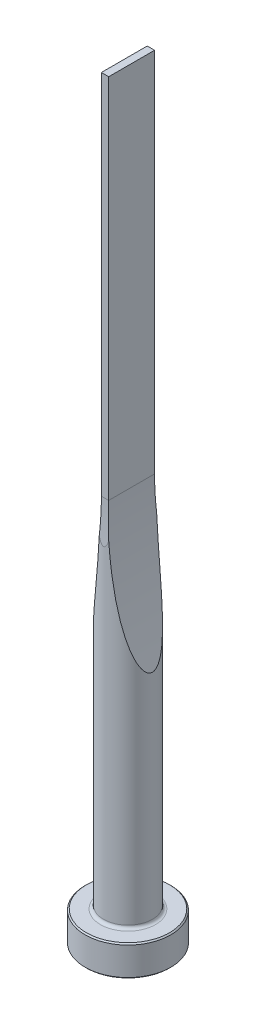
ISO-10303-21;
HEADER;
FILE_DESCRIPTION(('STEP AP214'),'2;1');
FILE_NAME('part.step','',(''),(''),'','','');
FILE_SCHEMA(('AUTOMOTIVE_DESIGN { 1 0 10303 214 1 1 1 1 }'));
ENDSEC;
DATA;
#1=APPLICATION_CONTEXT('core data for automotive mechanical design processes');
#2=APPLICATION_PROTOCOL_DEFINITION('international standard','automotive_design',2000,#1);
#3=PRODUCT_CONTEXT('',#1,'mechanical');
#4=PRODUCT('Part','Part','',(#3));
#5=PRODUCT_RELATED_PRODUCT_CATEGORY('part','',(#4));
#6=PRODUCT_DEFINITION_FORMATION('','',#4);
#7=PRODUCT_DEFINITION_CONTEXT('part definition',#1,'design');
#8=PRODUCT_DEFINITION('design','',#6,#7);
#9=PRODUCT_DEFINITION_SHAPE('','',#8);
#10=(LENGTH_UNIT() NAMED_UNIT(*) SI_UNIT(.MILLI.,.METRE.));
#11=(NAMED_UNIT(*) PLANE_ANGLE_UNIT() SI_UNIT($,.RADIAN.));
#12=(NAMED_UNIT(*) SI_UNIT($,.STERADIAN.) SOLID_ANGLE_UNIT());
#13=UNCERTAINTY_MEASURE_WITH_UNIT(LENGTH_MEASURE(1.E-05),#10,'distance_accuracy_value','');
#14=(GEOMETRIC_REPRESENTATION_CONTEXT(3) GLOBAL_UNCERTAINTY_ASSIGNED_CONTEXT((#13)) GLOBAL_UNIT_ASSIGNED_CONTEXT((#10,
#11,#12)) REPRESENTATION_CONTEXT('',''));
#15=CARTESIAN_POINT('',(0.,0.,0.));
#16=DIRECTION('',(0.,0.,1.));
#17=DIRECTION('',(1.,0.,0.));
#18=AXIS2_PLACEMENT_3D('',#15,#16,#17);
#19=CARTESIAN_POINT('',(0.,0.,0.));
#20=DIRECTION('',(0.,1.,0.));
#21=DIRECTION('',(-1.,0.,0.));
#22=AXIS2_PLACEMENT_3D('',#19,#20,#21);
#23=PLANE('',#22);
#24=CARTESIAN_POINT('',(0.,0.,0.));
#25=DIRECTION('',(0.,1.,0.));
#26=DIRECTION('',(-1.,0.,0.));
#27=AXIS2_PLACEMENT_3D('',#24,#25,#26);
#28=CIRCLE('',#27,6.8);
#29=CARTESIAN_POINT('',(-6.8,0.,0.));
#30=VERTEX_POINT('',#29);
#31=EDGE_CURVE('E133',#30,#30,#28,.T.);
#32=ORIENTED_EDGE('',*,*,#31,.F.);
#33=EDGE_LOOP('',(#32));
#34=FACE_BOUND('',#33,.T.);
#35=ADVANCED_FACE('F32',(#34),#23,.F.);
#36=CARTESIAN_POINT('',(0.,0.,0.));
#37=DIRECTION('',(0.,1.,0.));
#38=DIRECTION('',(-1.,0.,0.));
#39=AXIS2_PLACEMENT_3D('',#36,#37,#38);
#40=CONICAL_SURFACE('',#39,6.8,0.785398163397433);
#41=CARTESIAN_POINT('',(0.,0.200000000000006,0.));
#42=DIRECTION('',(0.,1.,0.));
#43=DIRECTION('',(-1.,0.,0.));
#44=AXIS2_PLACEMENT_3D('',#41,#42,#43);
#45=CIRCLE('',#44,7.);
#46=CARTESIAN_POINT('',(-7.,0.200000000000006,0.));
#47=VERTEX_POINT('',#46);
#48=EDGE_CURVE('E130',#47,#47,#45,.T.);
#49=ORIENTED_EDGE('',*,*,#48,.F.);
#50=EDGE_LOOP('',(#49));
#51=FACE_BOUND('',#50,.T.);
#52=ORIENTED_EDGE('',*,*,#31,.T.);
#53=EDGE_LOOP('',(#52));
#54=FACE_BOUND('',#53,.T.);
#55=ADVANCED_FACE('F171',(#51,#54),#40,.T.);
#56=CARTESIAN_POINT('',(0.,125.,0.));
#57=DIRECTION('',(0.,1.,0.));
#58=DIRECTION('',(-1.,0.,0.));
#59=AXIS2_PLACEMENT_3D('',#56,#57,#58);
#60=CYLINDRICAL_SURFACE('',#59,7.);
#61=CARTESIAN_POINT('',(0.,4.8,0.));
#62=DIRECTION('',(0.,1.,0.));
#63=DIRECTION('',(-1.,0.,0.));
#64=AXIS2_PLACEMENT_3D('',#61,#62,#63);
#65=CIRCLE('',#64,7.);
#66=CARTESIAN_POINT('',(-7.,4.8,0.));
#67=VERTEX_POINT('',#66);
#68=EDGE_CURVE('E127',#67,#67,#65,.T.);
#69=ORIENTED_EDGE('',*,*,#68,.F.);
#70=EDGE_LOOP('',(#69));
#71=FACE_BOUND('',#70,.T.);
#72=ORIENTED_EDGE('',*,*,#48,.T.);
#73=EDGE_LOOP('',(#72));
#74=FACE_BOUND('',#73,.T.);
#75=ADVANCED_FACE('F176',(#71,#74),#60,.T.);
#76=CARTESIAN_POINT('',(0.,4.8,0.));
#77=DIRECTION('',(0.,-1.,0.));
#78=DIRECTION('',(1.,0.,0.));
#79=AXIS2_PLACEMENT_3D('',#76,#77,#78);
#80=CONICAL_SURFACE('',#79,7.,0.785398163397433);
#81=CARTESIAN_POINT('',(0.,5.,0.));
#82=DIRECTION('',(0.,1.,0.));
#83=DIRECTION('',(-1.,0.,0.));
#84=AXIS2_PLACEMENT_3D('',#81,#82,#83);
#85=CIRCLE('',#84,6.8);
#86=CARTESIAN_POINT('',(-6.8,5.,0.));
#87=VERTEX_POINT('',#86);
#88=EDGE_CURVE('E124',#87,#87,#85,.T.);
#89=ORIENTED_EDGE('',*,*,#88,.F.);
#90=EDGE_LOOP('',(#89));
#91=FACE_BOUND('',#90,.T.);
#92=ORIENTED_EDGE('',*,*,#68,.T.);
#93=EDGE_LOOP('',(#92));
#94=FACE_BOUND('',#93,.T.);
#95=ADVANCED_FACE('F183',(#91,#94),#80,.T.);
#96=CARTESIAN_POINT('',(6.8,5.,0.));
#97=DIRECTION('',(0.,-1.,0.));
#98=DIRECTION('',(1.,0.,0.));
#99=AXIS2_PLACEMENT_3D('',#96,#97,#98);
#100=PLANE('',#99);
#101=CARTESIAN_POINT('',(0.,5.,0.));
#102=DIRECTION('',(0.,1.,0.));
#103=DIRECTION('',(-1.,0.,0.));
#104=AXIS2_PLACEMENT_3D('',#101,#102,#103);
#105=CIRCLE('',#104,4.50000000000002);
#106=CARTESIAN_POINT('',(-4.50000000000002,5.,0.));
#107=VERTEX_POINT('',#106);
#108=EDGE_CURVE('E121',#107,#107,#105,.T.);
#109=ORIENTED_EDGE('',*,*,#108,.F.);
#110=EDGE_LOOP('',(#109));
#111=FACE_BOUND('',#110,.T.);
#112=ORIENTED_EDGE('',*,*,#88,.T.);
#113=EDGE_LOOP('',(#112));
#114=FACE_BOUND('',#113,.T.);
#115=ADVANCED_FACE('F190',(#111,#114),#100,.F.);
#116=CARTESIAN_POINT('',(0.,5.5,0.));
#117=DIRECTION('',(0.,1.,0.));
#118=DIRECTION('',(-1.,0.,0.));
#119=AXIS2_PLACEMENT_3D('',#116,#117,#118);
#120=TOROIDAL_SURFACE('',#119,4.50000000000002,0.5);
#121=CARTESIAN_POINT('',(0.,5.50000000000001,0.));
#122=DIRECTION('',(0.,1.,0.));
#123=DIRECTION('',(-1.,0.,0.));
#124=AXIS2_PLACEMENT_3D('',#121,#122,#123);
#125=CIRCLE('',#124,4.00000000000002);
#126=CARTESIAN_POINT('',(-4.00000000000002,5.50000000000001,0.));
#127=VERTEX_POINT('',#126);
#128=EDGE_CURVE('E112',#127,#127,#125,.T.);
#129=ORIENTED_EDGE('',*,*,#128,.F.);
#130=EDGE_LOOP('',(#129));
#131=FACE_BOUND('',#130,.T.);
#132=ORIENTED_EDGE('',*,*,#108,.T.);
#133=EDGE_LOOP('',(#132));
#134=FACE_BOUND('',#133,.T.);
#135=ADVANCED_FACE('F168',(#131,#134),#120,.F.);
#136=CARTESIAN_POINT('',(0.,125.,0.));
#137=DIRECTION('',(0.,1.,0.));
#138=DIRECTION('',(-1.,0.,0.));
#139=AXIS2_PLACEMENT_3D('',#136,#137,#138);
#140=CYLINDRICAL_SURFACE('',#139,4.00000000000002);
#141=CARTESIAN_POINT('',(4.00000000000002,40.4961227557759,0.));
#142=CARTESIAN_POINT('',(3.99999564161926,40.4961377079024,0.0724134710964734));
#143=CARTESIAN_POINT('',(3.99800322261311,40.5031762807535,0.144924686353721));
#144=CARTESIAN_POINT('',(3.99031322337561,40.5303792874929,0.287279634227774));
#145=CARTESIAN_POINT('',(3.98460601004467,40.5505778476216,0.357115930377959));
#146=CARTESIAN_POINT('',(3.96856971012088,40.6074534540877,0.50730610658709));
#147=CARTESIAN_POINT('',(3.9574957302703,40.646793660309,0.586551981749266));
#148=CARTESIAN_POINT('',(3.93217275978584,40.7370671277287,0.737506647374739));
#149=CARTESIAN_POINT('',(3.91791778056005,40.7880222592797,0.809200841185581));
#150=CARTESIAN_POINT('',(3.88934869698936,40.8905537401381,0.936273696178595));
#151=CARTESIAN_POINT('',(3.87530210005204,40.9411185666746,0.99254853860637));
#152=CARTESIAN_POINT('',(3.84606514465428,41.0467582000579,1.10041297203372));
#153=CARTESIAN_POINT('',(3.83087387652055,41.1018365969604,1.15199876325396));
#154=CARTESIAN_POINT('',(3.79965336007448,41.2154818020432,1.25113546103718));
#155=CARTESIAN_POINT('',(3.7836223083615,41.2740561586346,1.29867705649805));
#156=CARTESIAN_POINT('',(3.75099135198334,41.3937815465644,1.39011393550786));
#157=CARTESIAN_POINT('',(3.73439162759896,41.4549317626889,1.43401035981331));
#158=CARTESIAN_POINT('',(3.69302416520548,41.6079842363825,1.53818457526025));
#159=CARTESIAN_POINT('',(3.66802493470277,41.7010453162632,1.59666444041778));
#160=CARTESIAN_POINT('',(3.6175101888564,41.8903465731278,1.708025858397));
#161=CARTESIAN_POINT('',(3.59199442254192,41.9865883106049,1.76090460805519));
#162=CARTESIAN_POINT('',(3.54064570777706,42.1816080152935,1.86200096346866));
#163=CARTESIAN_POINT('',(3.51481230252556,42.2803899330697,1.91021067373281));
#164=CARTESIAN_POINT('',(3.46302756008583,42.4798165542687,2.00255699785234));
#165=CARTESIAN_POINT('',(3.43707620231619,42.5804615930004,2.04669286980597));
#166=CARTESIAN_POINT('',(3.35898443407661,42.8855399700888,2.17422236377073));
#167=CARTESIAN_POINT('',(3.30684459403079,43.0922129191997,2.25228414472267));
#168=CARTESIAN_POINT('',(3.22913547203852,43.4050098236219,2.36106736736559));
#169=CARTESIAN_POINT('',(3.203328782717,43.5096864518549,2.39592801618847));
#170=CARTESIAN_POINT('',(3.15191115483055,43.7198812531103,2.4631794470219));
#171=CARTESIAN_POINT('',(3.12630021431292,43.8253994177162,2.49557025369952));
#172=CARTESIAN_POINT('',(3.05370800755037,44.1268778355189,2.58465377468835));
#173=CARTESIAN_POINT('',(3.00701123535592,44.3236961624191,2.63867658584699));
#174=CARTESIAN_POINT('',(2.91459477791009,44.7191969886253,2.74041090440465));
#175=CARTESIAN_POINT('',(2.86887523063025,44.9178797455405,2.78812152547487));
#176=CARTESIAN_POINT('',(2.77851421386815,45.3167970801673,2.87818171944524));
#177=CARTESIAN_POINT('',(2.73387326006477,45.5170323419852,2.92052876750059));
#178=CARTESIAN_POINT('',(2.64577308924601,45.9186934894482,3.00056953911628));
#179=CARTESIAN_POINT('',(2.60231393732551,46.1201194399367,3.03826300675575));
#180=CARTESIAN_POINT('',(2.47361423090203,46.7267618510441,3.14543682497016));
#181=CARTESIAN_POINT('',(2.39025159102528,47.1334599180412,3.20881732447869));
#182=CARTESIAN_POINT('',(2.22888225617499,47.9495283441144,3.32292076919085));
#183=CARTESIAN_POINT('',(2.15087426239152,48.3588980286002,3.37364679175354));
#184=CARTESIAN_POINT('',(2.00010529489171,49.181213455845,3.46516661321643));
#185=CARTESIAN_POINT('',(1.92736389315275,49.5941667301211,3.50592458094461));
#186=CARTESIAN_POINT('',(1.78755023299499,50.4217659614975,3.57922983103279));
#187=CARTESIAN_POINT('',(1.72047824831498,50.836411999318,3.61177671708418));
#188=CARTESIAN_POINT('',(1.59216998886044,51.6664957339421,3.67014347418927));
#189=CARTESIAN_POINT('',(1.53092595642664,52.0819316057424,3.69597236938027));
#190=CARTESIAN_POINT('',(1.41422203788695,52.9139140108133,3.74217950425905));
#191=CARTESIAN_POINT('',(1.35876219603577,53.3304605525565,3.76255770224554));
#192=CARTESIAN_POINT('',(1.23052997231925,54.3480416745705,3.80686626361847));
#193=CARTESIAN_POINT('',(1.16088260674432,54.9495757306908,3.82841184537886));
#194=CARTESIAN_POINT('',(1.03372424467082,56.1541488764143,3.86468251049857));
#195=CARTESIAN_POINT('',(0.976213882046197,56.757188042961,3.87940723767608));
#196=CARTESIAN_POINT('',(0.873363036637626,57.9645352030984,3.90384820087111));
#197=CARTESIAN_POINT('',(0.828025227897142,58.5688434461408,3.91356333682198));
#198=CARTESIAN_POINT('',(0.749563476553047,59.7782873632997,3.92934517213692));
#199=CARTESIAN_POINT('',(0.716439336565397,60.3834230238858,3.93541193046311));
#200=CARTESIAN_POINT('',(0.662359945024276,61.595618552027,3.94487439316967));
#201=CARTESIAN_POINT('',(0.641432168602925,62.2026796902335,3.94826407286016));
#202=CARTESIAN_POINT('',(0.611870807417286,63.4171113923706,3.95295302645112));
#203=CARTESIAN_POINT('',(0.603237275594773,64.0244819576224,3.95425229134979));
#204=CARTESIAN_POINT('',(0.598268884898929,65.2391651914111,3.95500702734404));
#205=CARTESIAN_POINT('',(0.601931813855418,65.8464778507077,3.95446283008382));
#206=CARTESIAN_POINT('',(0.621549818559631,67.0608983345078,3.95142691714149));
#207=CARTESIAN_POINT('',(0.637504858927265,67.6680061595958,3.94893520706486));
#208=CARTESIAN_POINT('',(0.681565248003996,68.8780670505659,3.94156883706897));
#209=CARTESIAN_POINT('',(0.709596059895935,69.4810229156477,3.93670877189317));
#210=CARTESIAN_POINT('',(0.777780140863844,70.6862209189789,3.92380724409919));
#211=CARTESIAN_POINT('',(0.817933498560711,71.2884630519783,3.91576575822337));
#212=CARTESIAN_POINT('',(0.910362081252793,72.4922231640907,3.89531575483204));
#213=CARTESIAN_POINT('',(0.962642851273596,73.0937406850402,3.88290523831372));
#214=CARTESIAN_POINT('',(1.0792809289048,74.2954434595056,3.85211559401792));
#215=CARTESIAN_POINT('',(1.14363798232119,74.8956287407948,3.8337365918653));
#216=CARTESIAN_POINT('',(1.28415058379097,76.0923779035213,3.78898225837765));
#217=CARTESIAN_POINT('',(1.36026767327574,76.6889472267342,3.7626327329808));
#218=CARTESIAN_POINT('',(1.52436736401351,77.879948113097,3.69919550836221));
#219=CARTESIAN_POINT('',(1.61235107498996,78.474379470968,3.66210680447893));
#220=CARTESIAN_POINT('',(1.79995345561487,79.6598583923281,3.57365007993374));
#221=CARTESIAN_POINT('',(1.89956189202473,80.2509084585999,3.52229456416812));
#222=CARTESIAN_POINT('',(2.05751784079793,81.1343850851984,3.43078434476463));
#223=CARTESIAN_POINT('',(2.11158852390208,81.4283349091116,3.39787168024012));
#224=CARTESIAN_POINT('',(2.22252257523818,82.0150103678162,3.32637407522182));
#225=CARTESIAN_POINT('',(2.27938579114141,82.3077360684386,3.28778944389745));
#226=CARTESIAN_POINT('',(2.37335149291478,82.7789740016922,3.22011433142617));
#227=CARTESIAN_POINT('',(2.40960878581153,82.9579556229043,3.19310843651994));
#228=CARTESIAN_POINT('',(2.48312261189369,83.3152719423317,3.13628169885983));
#229=CARTESIAN_POINT('',(2.5203791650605,83.4936066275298,3.1064607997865));
#230=CARTESIAN_POINT('',(2.59587928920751,83.8496118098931,3.04365297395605));
#231=CARTESIAN_POINT('',(2.63412337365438,84.0272819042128,3.01066437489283));
#232=CARTESIAN_POINT('',(2.71153832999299,84.3817235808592,2.94113375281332));
#233=CARTESIAN_POINT('',(2.75070919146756,84.5584951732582,2.90459176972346));
#234=CARTESIAN_POINT('',(2.83003427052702,84.9114520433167,2.82736273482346));
#235=CARTESIAN_POINT('',(2.87019091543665,85.0876343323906,2.78666446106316));
#236=CARTESIAN_POINT('',(2.95130772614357,85.4386689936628,2.70060749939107));
#237=CARTESIAN_POINT('',(2.99226785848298,85.6135214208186,2.65524900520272));
#238=CARTESIAN_POINT('',(3.07485965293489,85.961434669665,2.55915064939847));
#239=CARTESIAN_POINT('',(3.11649075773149,86.1344968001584,2.50841507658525));
#240=CARTESIAN_POINT('',(3.20030527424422,86.4784703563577,2.40056525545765));
#241=CARTESIAN_POINT('',(3.24248860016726,86.6493821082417,2.34345198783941));
#242=CARTESIAN_POINT('',(3.32761650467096,86.9900474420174,2.2209449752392));
#243=CARTESIAN_POINT('',(3.37056449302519,87.1597733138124,2.1554756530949));
#244=CARTESIAN_POINT('',(3.45650933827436,87.4953789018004,2.0147836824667));
#245=CARTESIAN_POINT('',(3.49950619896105,87.661254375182,1.93955082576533));
#246=CARTESIAN_POINT('',(3.58466359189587,87.9860639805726,1.77724053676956));
#247=CARTESIAN_POINT('',(3.62682777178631,88.1450367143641,1.69024459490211));
#248=CARTESIAN_POINT('',(3.68879218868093,88.3762346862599,1.54772713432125));
#249=CARTESIAN_POINT('',(3.70921535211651,88.452024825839,1.49826783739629));
#250=CARTESIAN_POINT('',(3.74941531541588,88.6004627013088,1.39462493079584));
#251=CARTESIAN_POINT('',(3.76919236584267,88.6731116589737,1.34044318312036));
#252=CARTESIAN_POINT('',(3.81294137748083,88.8330657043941,1.21132384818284));
#253=CARTESIAN_POINT('',(3.83662600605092,88.9191144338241,1.13470379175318));
#254=CARTESIAN_POINT('',(3.8814050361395,89.0809527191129,0.970527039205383));
#255=CARTESIAN_POINT('',(3.90250393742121,89.1567601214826,0.882989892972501));
#256=CARTESIAN_POINT('',(3.93398752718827,89.2694148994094,0.726495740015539));
#257=CARTESIAN_POINT('',(3.94559651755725,89.3108163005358,0.66110458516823));
#258=CARTESIAN_POINT('',(3.9660572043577,89.3836294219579,0.524532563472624));
#259=CARTESIAN_POINT('',(3.97491309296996,89.4150563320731,0.453360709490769));
#260=CARTESIAN_POINT('',(3.98768281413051,89.4603141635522,0.319456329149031));
#261=CARTESIAN_POINT('',(3.99220018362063,89.4762973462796,0.25751952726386));
#262=CARTESIAN_POINT('',(3.99832424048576,89.4979568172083,0.131735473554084));
#263=CARTESIAN_POINT('',(3.99993382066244,89.5036433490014,0.0678901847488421));
#264=CARTESIAN_POINT('',(4.00006223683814,89.5040972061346,-0.0599473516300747));
#265=CARTESIAN_POINT('',(3.99857607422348,89.4988468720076,-0.123939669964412));
#266=CARTESIAN_POINT('',(3.99267617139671,89.4779813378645,-0.250075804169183));
#267=CARTESIAN_POINT('',(3.98825964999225,89.4623562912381,-0.312217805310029));
#268=CARTESIAN_POINT('',(3.97527309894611,89.4163348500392,-0.450974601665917));
#269=CARTESIAN_POINT('',(3.96586622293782,89.3829553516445,-0.526508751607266));
#270=CARTESIAN_POINT('',(3.94398370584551,89.3050707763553,-0.671103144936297));
#271=CARTESIAN_POINT('',(3.93150139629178,89.2605415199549,-0.740148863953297));
#272=CARTESIAN_POINT('',(3.90656010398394,89.1712490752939,-0.861383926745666));
#273=CARTESIAN_POINT('',(3.89441124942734,89.1276425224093,-0.914510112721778));
#274=CARTESIAN_POINT('',(3.86899878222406,89.0361328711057,-1.01667208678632));
#275=CARTESIAN_POINT('',(3.85573433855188,88.9882265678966,-1.06570477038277));
#276=CARTESIAN_POINT('',(3.82836739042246,88.8890441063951,-1.16018395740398));
#277=CARTESIAN_POINT('',(3.81426309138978,88.8377607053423,-1.20562226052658));
#278=CARTESIAN_POINT('',(3.78546325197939,88.7326606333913,-1.29320936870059));
#279=CARTESIAN_POINT('',(3.77076787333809,88.6788446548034,-1.33535906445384));
#280=CARTESIAN_POINT('',(3.73512522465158,88.5478184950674,-1.43264720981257));
#281=CARTESIAN_POINT('',(3.7139743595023,88.4696681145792,-1.48644230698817));
#282=CARTESIAN_POINT('',(3.67112376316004,88.3104546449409,-1.58932194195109));
#283=CARTESIAN_POINT('',(3.64942378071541,88.2293902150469,-1.63840427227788));
#284=CARTESIAN_POINT('',(3.58375426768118,87.9826433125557,-1.77976912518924));
#285=CARTESIAN_POINT('',(3.53927682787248,87.8136334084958,-1.8660091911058));
#286=CARTESIAN_POINT('',(3.44977897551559,87.4693316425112,-2.02668892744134));
#287=CARTESIAN_POINT('',(3.40475697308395,87.2940131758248,-2.101069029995));
#288=CARTESIAN_POINT('',(3.31494343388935,86.9397415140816,-2.24008593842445));
#289=CARTESIAN_POINT('',(3.27015171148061,86.7607921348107,-2.30473242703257));
#290=CARTESIAN_POINT('',(3.18612289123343,86.4205796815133,-2.41931179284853));
#291=CARTESIAN_POINT('',(3.1468311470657,86.2596084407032,-2.47008185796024));
#292=CARTESIAN_POINT('',(3.06878971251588,85.935972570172,-2.56639084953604));
#293=CARTESIAN_POINT('',(3.0300400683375,85.7733077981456,-2.61192933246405));
#294=CARTESIAN_POINT('',(2.91473222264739,85.2831566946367,-2.74186435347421));
#295=CARTESIAN_POINT('',(2.83914992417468,84.9536543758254,-2.81953466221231));
#296=CARTESIAN_POINT('',(2.69097804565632,84.2904032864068,-2.96126843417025));
#297=CARTESIAN_POINT('',(2.61839496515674,83.9566471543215,-3.02530347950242));
#298=CARTESIAN_POINT('',(2.4766639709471,83.286469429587,-3.14238445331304));
#299=CARTESIAN_POINT('',(2.40751642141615,82.9500475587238,-3.1954292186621));
#300=CARTESIAN_POINT('',(2.27265074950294,82.2742142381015,-3.29271652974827));
#301=CARTESIAN_POINT('',(2.20694335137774,81.9347968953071,-3.33693263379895));
#302=CARTESIAN_POINT('',(2.07929343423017,81.254363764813,-3.41793037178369));
#303=CARTESIAN_POINT('',(2.01735109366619,80.9133479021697,-3.45471165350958));
#304=CARTESIAN_POINT('',(1.89739134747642,80.2304709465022,-3.52202050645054));
#305=CARTESIAN_POINT('',(1.83936902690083,79.888611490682,-3.552556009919));
#306=CARTESIAN_POINT('',(1.72721773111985,79.2038359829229,-3.60841172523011));
#307=CARTESIAN_POINT('',(1.67308875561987,78.860919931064,-3.63373193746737));
#308=CARTESIAN_POINT('',(1.53321874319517,77.940225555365,-3.69573828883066));
#309=CARTESIAN_POINT('',(1.45106925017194,77.3616278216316,-3.72841306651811));
#310=CARTESIAN_POINT('',(1.29800476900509,76.2024765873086,-3.78441543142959));
#311=CARTESIAN_POINT('',(1.22709062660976,75.6219229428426,-3.80774231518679));
#312=CARTESIAN_POINT('',(1.09655325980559,74.4591433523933,-3.84736572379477));
#313=CARTESIAN_POINT('',(1.03693331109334,73.8769169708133,-3.86366021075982));
#314=CARTESIAN_POINT('',(0.929055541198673,72.7113092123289,-3.89100856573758));
#315=CARTESIAN_POINT('',(0.880797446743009,72.1279278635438,-3.90206255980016));
#316=CARTESIAN_POINT('',(0.795592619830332,70.9592214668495,-3.920323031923));
#317=CARTESIAN_POINT('',(0.758666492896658,70.3738948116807,-3.92752251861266));
#318=CARTESIAN_POINT('',(0.696262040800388,69.2026016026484,-3.93906396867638));
#319=CARTESIAN_POINT('',(0.670783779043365,68.6166350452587,-3.94340591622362));
#320=CARTESIAN_POINT('',(0.631290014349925,67.444400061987,-3.94992062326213));
#321=CARTESIAN_POINT('',(0.617272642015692,66.8581317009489,-3.95209373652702));
#322=CARTESIAN_POINT('',(0.600699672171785,65.6854307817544,-3.95464664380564));
#323=CARTESIAN_POINT('',(0.598144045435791,65.0989982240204,-3.95502644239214));
#324=CARTESIAN_POINT('',(0.604484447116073,63.9282455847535,-3.95406229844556));
#325=CARTESIAN_POINT('',(0.613340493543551,63.3439252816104,-3.95272437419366));
#326=CARTESIAN_POINT('',(0.642431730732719,62.1755736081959,-3.94810065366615));
#327=CARTESIAN_POINT('',(0.662666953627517,61.5915422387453,-3.94481485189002));
#328=CARTESIAN_POINT('',(0.71451277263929,60.4238908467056,-3.93575467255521));
#329=CARTESIAN_POINT('',(0.746125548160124,59.8402709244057,-3.92997981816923));
#330=CARTESIAN_POINT('',(0.820710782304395,58.6738024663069,-3.91508384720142));
#331=CARTESIAN_POINT('',(0.863683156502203,58.0909539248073,-3.90596275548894));
#332=CARTESIAN_POINT('',(0.960884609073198,56.9272467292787,-3.88319332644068));
#333=CARTESIAN_POINT('',(1.0150950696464,56.3463863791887,-3.86955245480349));
#334=CARTESIAN_POINT('',(1.13478238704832,55.1859765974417,-3.83616145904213));
#335=CARTESIAN_POINT('',(1.20025961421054,54.6064272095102,-3.81641113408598));
#336=CARTESIAN_POINT('',(1.34239625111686,53.4492480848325,-3.76876527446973));
#337=CARTESIAN_POINT('',(1.41905154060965,52.8716177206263,-3.74087273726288));
#338=CARTESIAN_POINT('',(1.58346740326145,51.7185860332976,-3.6743062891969));
#339=CARTESIAN_POINT('',(1.67122682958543,51.1431844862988,-3.63563349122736));
#340=CARTESIAN_POINT('',(1.78780397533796,50.4255342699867,-3.57832702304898));
#341=CARTESIAN_POINT('',(1.8114945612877,50.2818994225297,-3.56640112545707));
#342=CARTESIAN_POINT('',(1.85955822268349,49.9948285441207,-3.54157829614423));
#343=CARTESIAN_POINT('',(1.8839312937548,49.8513925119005,-3.52868137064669));
#344=CARTESIAN_POINT('',(1.9580698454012,49.4213981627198,-3.48842778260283));
#345=CARTESIAN_POINT('',(2.00885380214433,49.135158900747,-3.45950872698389));
#346=CARTESIAN_POINT('',(2.11307968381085,48.5637829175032,-3.39685068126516));
#347=CARTESIAN_POINT('',(2.16652076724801,48.2786458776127,-3.36311321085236));
#348=CARTESIAN_POINT('',(2.27601482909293,47.7096094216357,-3.28999715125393));
#349=CARTESIAN_POINT('',(2.33206772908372,47.4257099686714,-3.25061873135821));
#350=CARTESIAN_POINT('',(2.46860643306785,46.7512532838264,-3.14893656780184));
#351=CARTESIAN_POINT('',(2.55024834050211,46.3613673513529,-3.08362075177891));
#352=CARTESIAN_POINT('',(2.6760684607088,45.7796556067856,-2.97350542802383));
#353=CARTESIAN_POINT('',(2.71855977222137,45.5863071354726,-2.93478510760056));
#354=CARTESIAN_POINT('',(2.80459946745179,45.2008426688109,-2.85267651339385));
#355=CARTESIAN_POINT('',(2.8481478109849,45.0087266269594,-2.80928841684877));
#356=CARTESIAN_POINT('',(2.95374235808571,44.5498445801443,-2.69877172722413));
#357=CARTESIAN_POINT('',(3.01625290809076,44.2837977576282,-2.62906697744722));
#358=CARTESIAN_POINT('',(3.1429084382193,43.7554491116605,-2.47629605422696));
#359=CARTESIAN_POINT('',(3.20705554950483,43.4931529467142,-2.39321162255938));
#360=CARTESIAN_POINT('',(3.30572146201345,43.0972866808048,-2.25292733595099));
#361=CARTESIAN_POINT('',(3.33993028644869,42.9614070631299,-2.20202594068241));
#362=CARTESIAN_POINT('',(3.40842047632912,42.6919800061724,-2.09445657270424));
#363=CARTESIAN_POINT('',(3.44270182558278,42.558432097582,-2.03778977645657));
#364=CARTESIAN_POINT('',(3.51102218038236,42.2947484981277,-1.91767763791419));
#365=CARTESIAN_POINT('',(3.54506157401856,42.1646052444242,-1.85424925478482));
#366=CARTESIAN_POINT('',(3.61259911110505,41.9086691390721,-1.71896967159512));
#367=CARTESIAN_POINT('',(3.64609760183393,41.7828734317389,-1.64712414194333));
#368=CARTESIAN_POINT('',(3.70554577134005,41.5614784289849,-1.5078099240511));
#369=CARTESIAN_POINT('',(3.73169584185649,41.4647668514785,-1.4422104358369));
#370=CARTESIAN_POINT('',(3.78277813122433,41.2770269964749,-1.30236256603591));
#371=CARTESIAN_POINT('',(3.8077077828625,41.1860105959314,-1.2280969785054));
#372=CARTESIAN_POINT('',(3.85567653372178,41.0118658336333,-1.06810478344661));
#373=CARTESIAN_POINT('',(3.87869011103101,40.9288421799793,-0.982254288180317));
#374=CARTESIAN_POINT('',(3.92082845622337,40.7775449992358,-0.79749587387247));
#375=CARTESIAN_POINT('',(3.93996853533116,40.7092133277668,-0.698642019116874));
#376=CARTESIAN_POINT('',(3.96488637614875,40.6205363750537,-0.532363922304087));
#377=CARTESIAN_POINT('',(3.97287767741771,40.5921680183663,-0.469585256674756));
#378=CARTESIAN_POINT('',(3.98603728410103,40.5455105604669,-0.340150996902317));
#379=CARTESIAN_POINT('',(3.9912133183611,40.5271938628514,-0.273506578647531));
#380=CARTESIAN_POINT('',(3.99645206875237,40.5086643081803,-0.171843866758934));
#381=CARTESIAN_POINT('',(3.99777744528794,40.5039786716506,-0.137668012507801));
#382=CARTESIAN_POINT('',(3.99955257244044,40.4977038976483,-0.0690022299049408));
#383=CARTESIAN_POINT('',(4.00000207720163,40.4961156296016,-0.0345122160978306));
#384=CARTESIAN_POINT('',(4.00000000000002,40.4961227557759,0.));
#385=B_SPLINE_CURVE_WITH_KNOTS('',3,(#141,#142,#143,#144,#145,#146,#147,#148,#149,#150,#151,
#152,#153,#154,#155,#156,#157,#158,#159,#160,#161,#162,#163,#164,#165,#166,#167,#168,#169,#170,
#171,#172,#173,#174,#175,#176,#177,#178,#179,#180,#181,#182,#183,#184,#185,#186,#187,#188,#189,
#190,#191,#192,#193,#194,#195,#196,#197,#198,#199,#200,#201,#202,#203,#204,#205,#206,#207,#208,
#209,#210,#211,#212,#213,#214,#215,#216,#217,#218,#219,#220,#221,#222,#223,#224,#225,#226,#227,
#228,#229,#230,#231,#232,#233,#234,#235,#236,#237,#238,#239,#240,#241,#242,#243,#244,#245,#246,
#247,#248,#249,#250,#251,#252,#253,#254,#255,#256,#257,#258,#259,#260,#261,#262,#263,#264,#265,
#266,#267,#268,#269,#270,#271,#272,#273,#274,#275,#276,#277,#278,#279,#280,#281,#282,#283,#284,
#285,#286,#287,#288,#289,#290,#291,#292,#293,#294,#295,#296,#297,#298,#299,#300,#301,#302,#303,
#304,#305,#306,#307,#308,#309,#310,#311,#312,#313,#314,#315,#316,#317,#318,#319,#320,#321,#322,
#323,#324,#325,#326,#327,#328,#329,#330,#331,#332,#333,#334,#335,#336,#337,#338,#339,#340,#341,
#342,#343,#344,#345,#346,#347,#348,#349,#350,#351,#352,#353,#354,#355,#356,#357,#358,#359,#360,
#361,#362,#363,#364,#365,#366,#367,#368,#369,#370,#371,#372,#373,#374,#375,#376,#377,#378,#379,
#380,#381,#382,#383,#384),.UNSPECIFIED.,.T.,.F.,(4,2,2,2,2,2,2,2,2,2,2,2,2,2,2,2,2,2,2,2,2,2,2,
2,2,2,2,2,2,2,2,2,2,2,2,2,2,2,2,2,2,2,2,2,2,2,2,2,2,2,2,2,2,2,2,2,2,2,2,2,2,2,2,2,2,2,2,2,2,2,2,
2,2,2,2,2,2,2,2,2,2,2,2,2,2,2,2,2,2,2,2,2,2,2,2,2,2,2,2,2,2,2,2,2,2,2,2,2,2,2,2,2,2,2,2,2,2,2,2,
2,2,4),(0.,0.217071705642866,0.434708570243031,0.700672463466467,0.967141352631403,
1.19765545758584,1.42835472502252,1.65957152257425,1.89071568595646,2.22861679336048,
2.56668621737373,2.90531769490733,3.24401072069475,3.92450632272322,4.26441084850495,
4.60431197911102,5.23228898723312,5.86035407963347,6.48871373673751,7.11710793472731,
8.37667122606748,9.63592791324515,10.8996467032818,12.1634264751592,13.4254997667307,
14.6875827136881,16.5052028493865,18.3229178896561,20.1410319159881,21.9591165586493,
23.7812811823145,25.6034536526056,27.4252983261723,29.2471377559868,31.0578896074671,
32.8686546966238,34.6802493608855,36.4918058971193,38.297558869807,40.1034808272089,
41.9078248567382,42.8098366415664,43.7117992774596,44.2655877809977,44.8193873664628,
45.3734809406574,45.9275682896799,46.4831933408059,47.0387953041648,47.593957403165,
48.1490342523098,48.7095441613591,49.2706449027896,49.8280406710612,50.1062328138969,
50.3843157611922,50.7365369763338,51.0881362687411,51.3222456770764,51.5559968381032,
51.7475528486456,51.9389181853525,52.1305927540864,52.3224495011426,52.5704006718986,
52.8188942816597,53.0279863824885,53.2372356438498,53.4469492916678,53.6566059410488,
53.9480075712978,54.2395450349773,54.8234681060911,55.4102374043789,55.9964190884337,
56.5162238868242,57.0360727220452,58.0762260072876,59.1185263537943,60.1609369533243,
61.2064242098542,62.2519609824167,63.2961615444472,64.3403620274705,66.0960707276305,
67.8519115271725,69.6082608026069,71.3645678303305,73.1240497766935,74.8835414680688,
76.6427461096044,78.4019462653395,80.1549996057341,81.9080578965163,83.6614521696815,
85.4148334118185,87.1653327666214,88.9158896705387,90.6658029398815,92.4155356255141,
92.8537216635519,93.2919048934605,94.1682875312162,95.0443943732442,95.9204749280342,
97.1311135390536,97.7362062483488,98.341275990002,99.1871473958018,100.034183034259,
100.481319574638,100.928365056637,101.374314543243,101.819965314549,102.178888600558,
102.53853703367,102.902391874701,103.264779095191,103.472139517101,103.678927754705,
103.782354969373,103.885811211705),.UNSPECIFIED.);
#386=CARTESIAN_POINT('',(0.774335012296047,59.4009010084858,-3.92433501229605));
#387=VERTEX_POINT('',#386);
#388=CARTESIAN_POINT('',(0.77433501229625,59.4009010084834,3.92433501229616));
#389=VERTEX_POINT('',#388);
#390=EDGE_CURVE('E138',#387,#389,#385,.T.);
#391=ORIENTED_EDGE('',*,*,#390,.T.);
#392=CARTESIAN_POINT('',(-1.39194109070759,65.,3.74999999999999));
#393=CARTESIAN_POINT('',(-1.39194449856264,65.3340996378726,3.7500000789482));
#394=CARTESIAN_POINT('',(-1.38695792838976,65.668209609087,3.75186098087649));
#395=CARTESIAN_POINT('',(-1.366673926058,66.3360771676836,3.75929815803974));
#396=CARTESIAN_POINT('',(-1.35137656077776,66.6698347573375,3.76487440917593));
#397=CARTESIAN_POINT('',(-1.30923320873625,67.3374065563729,3.7797366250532));
#398=CARTESIAN_POINT('',(-1.28235776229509,67.6712187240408,3.78903204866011));
#399=CARTESIAN_POINT('',(-1.21470251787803,68.3371930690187,3.81127649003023));
#400=CARTESIAN_POINT('',(-1.17393087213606,68.6693560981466,3.82422336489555));
#401=CARTESIAN_POINT('',(-1.0984461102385,69.1657630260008,3.84630718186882));
#402=CARTESIAN_POINT('',(-1.07085040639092,69.3311442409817,3.85412453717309));
#403=CARTESIAN_POINT('',(-1.00961852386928,69.6608992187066,3.87061811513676));
#404=CARTESIAN_POINT('',(-0.975977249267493,69.8252720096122,3.87929505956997));
#405=CARTESIAN_POINT('',(-0.900897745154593,70.1517938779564,3.89742276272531));
#406=CARTESIAN_POINT('',(-0.859480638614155,70.3139477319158,3.90687138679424));
#407=CARTESIAN_POINT('',(-0.788768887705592,70.5545158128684,3.92153114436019));
#408=CARTESIAN_POINT('',(-0.763786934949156,70.6342087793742,3.92649537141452));
#409=CARTESIAN_POINT('',(-0.71014168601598,70.7923268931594,3.93655330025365));
#410=CARTESIAN_POINT('',(-0.681479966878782,70.8707525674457,3.94164694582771));
#411=CARTESIAN_POINT('',(-0.619110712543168,71.0259141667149,3.95192410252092));
#412=CARTESIAN_POINT('',(-0.585384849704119,71.1026427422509,3.95710787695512));
#413=CARTESIAN_POINT('',(-0.510918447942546,71.2524891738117,3.9674185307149));
#414=CARTESIAN_POINT('',(-0.470205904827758,71.3256199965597,3.97254555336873));
#415=CARTESIAN_POINT('',(-0.405871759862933,71.4217687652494,3.97939443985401));
#416=CARTESIAN_POINT('',(-0.387100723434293,71.4479908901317,3.98127456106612));
#417=CARTESIAN_POINT('',(-0.347340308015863,71.4988380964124,3.98494137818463));
#418=CARTESIAN_POINT('',(-0.32634572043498,71.5234591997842,3.98672783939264));
#419=CARTESIAN_POINT('',(-0.28138142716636,71.570454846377,3.99015550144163));
#420=CARTESIAN_POINT('',(-0.257378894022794,71.5927987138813,3.99179469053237));
#421=CARTESIAN_POINT('',(-0.206002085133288,71.6332343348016,3.99477391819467));
#422=CARTESIAN_POINT('',(-0.178643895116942,71.6513452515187,3.99611530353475));
#423=CARTESIAN_POINT('',(-0.133196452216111,71.6742305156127,3.99781497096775));
#424=CARTESIAN_POINT('',(-0.116315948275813,71.6813683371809,3.99834625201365));
#425=CARTESIAN_POINT('',(-0.0816311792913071,71.6928863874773,3.99920443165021));
#426=CARTESIAN_POINT('',(-0.0638281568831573,71.6972702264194,3.99953159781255));
#427=CARTESIAN_POINT('',(-0.0275781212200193,71.7028240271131,3.99994619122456));
#428=CARTESIAN_POINT('',(-0.00912739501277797,71.7039706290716,4.00003187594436));
#429=CARTESIAN_POINT('',(0.0276703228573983,71.7028293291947,3.99994663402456));
#430=CARTESIAN_POINT('',(0.0460172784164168,71.700540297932,3.99977562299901));
#431=CARTESIAN_POINT('',(0.0805943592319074,71.6931273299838,3.99922251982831));
#432=CARTESIAN_POINT('',(0.096877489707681,71.6882404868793,3.99885808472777));
#433=CARTESIAN_POINT('',(0.128581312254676,71.6762358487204,3.99796430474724));
#434=CARTESIAN_POINT('',(0.144001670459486,71.6691171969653,3.99743489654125));
#435=CARTESIAN_POINT('',(0.18500697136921,71.6471511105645,3.99580470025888));
#436=CARTESIAN_POINT('',(0.209611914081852,71.6304953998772,3.99457196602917));
#437=CARTESIAN_POINT('',(0.256071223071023,71.5937200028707,3.99186273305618));
#438=CARTESIAN_POINT('',(0.2779151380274,71.5735877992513,3.99038535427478));
#439=CARTESIAN_POINT('',(0.350665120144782,71.499085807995,3.98494736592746));
#440=CARTESIAN_POINT('',(0.395552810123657,71.4389897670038,3.98061079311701));
#441=CARTESIAN_POINT('',(0.476792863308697,71.3133434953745,3.97168524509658));
#442=CARTESIAN_POINT('',(0.513090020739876,71.2477614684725,3.967094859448));
#443=CARTESIAN_POINT('',(0.605299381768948,71.0631758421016,3.95438947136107));
#444=CARTESIAN_POINT('',(0.655314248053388,70.9412436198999,3.94623160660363));
#445=CARTESIAN_POINT('',(0.745376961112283,70.6936668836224,3.93019294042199));
#446=CARTESIAN_POINT('',(0.785397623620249,70.5680132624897,3.92231294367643));
#447=CARTESIAN_POINT('',(0.858576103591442,70.3143608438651,3.90694950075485));
#448=CARTESIAN_POINT('',(0.891716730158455,70.1863570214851,3.89946708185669));
#449=CARTESIAN_POINT('',(0.952763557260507,69.9292949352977,3.88499773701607));
#450=CARTESIAN_POINT('',(0.980676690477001,69.8002383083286,3.87801016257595));
#451=CARTESIAN_POINT('',(1.05809609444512,69.4130670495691,3.85789047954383));
#452=CARTESIAN_POINT('',(1.10161068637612,69.1537155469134,3.84552636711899));
#453=CARTESIAN_POINT('',(1.17739914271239,68.6332486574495,3.82298810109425));
#454=CARTESIAN_POINT('',(1.20966805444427,68.3721325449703,3.81281491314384));
#455=CARTESIAN_POINT('',(1.26533785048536,67.8484213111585,3.79470411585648));
#456=CARTESIAN_POINT('',(1.28872293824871,67.5858243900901,3.78677049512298));
#457=CARTESIAN_POINT('',(1.32794213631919,67.0599951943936,3.77319404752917));
#458=CARTESIAN_POINT('',(1.34377550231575,66.7967628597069,3.76755144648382));
#459=CARTESIAN_POINT('',(1.36866096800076,66.2703935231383,3.75858225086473));
#460=CARTESIAN_POINT('',(1.37772460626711,66.0072571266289,3.75525171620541));
#461=CARTESIAN_POINT('',(1.38952938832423,65.4808229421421,3.75089945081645));
#462=CARTESIAN_POINT('',(1.39227046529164,65.2175251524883,3.74987774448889));
#463=CARTESIAN_POINT('',(1.39154941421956,64.6912325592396,3.75014538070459));
#464=CARTESIAN_POINT('',(1.38809419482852,64.4282377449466,3.75143214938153));
#465=CARTESIAN_POINT('',(1.37484398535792,63.9024375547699,3.75630869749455));
#466=CARTESIAN_POINT('',(1.36504925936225,63.6396321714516,3.7598983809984));
#467=CARTESIAN_POINT('',(1.33880225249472,63.1170444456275,3.76932382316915));
#468=CARTESIAN_POINT('',(1.32241801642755,62.8572583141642,3.77513659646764));
#469=CARTESIAN_POINT('',(1.28217391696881,62.3382024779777,3.78899593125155));
#470=CARTESIAN_POINT('',(1.25831091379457,62.0789330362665,3.7970434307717));
#471=CARTESIAN_POINT('',(1.20163024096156,61.5608244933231,3.81536023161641));
#472=CARTESIAN_POINT('',(1.16879164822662,61.3019878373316,3.8256347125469));
#473=CARTESIAN_POINT('',(1.09180587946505,60.7862363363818,3.8483276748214));
#474=CARTESIAN_POINT('',(1.04766828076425,60.5293200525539,3.86074433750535));
#475=CARTESIAN_POINT('',(0.969147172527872,60.1457963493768,3.88091053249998));
#476=CARTESIAN_POINT('',(0.940826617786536,60.0179166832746,3.88791072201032));
#477=CARTESIAN_POINT('',(0.878848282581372,59.7632801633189,3.9023898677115));
#478=CARTESIAN_POINT('',(0.845183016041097,59.6365251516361,3.90986948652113));
#479=CARTESIAN_POINT('',(0.770839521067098,59.3854811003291,3.92521002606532));
#480=CARTESIAN_POINT('',(0.730184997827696,59.2611852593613,3.9330695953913));
#481=CARTESIAN_POINT('',(0.661250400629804,59.0778844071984,3.94503185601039));
#482=CARTESIAN_POINT('',(0.63697799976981,59.0173732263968,3.94904355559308));
#483=CARTESIAN_POINT('',(0.584962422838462,58.8978769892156,3.95708454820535));
#484=CARTESIAN_POINT('',(0.557221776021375,58.8388908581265,3.96111382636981));
#485=CARTESIAN_POINT('',(0.496796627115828,58.7229032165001,3.96914753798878));
#486=CARTESIAN_POINT('',(0.46407508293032,58.6659208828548,3.97315152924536));
#487=CARTESIAN_POINT('',(0.391808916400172,58.5565882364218,3.98093309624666));
#488=CARTESIAN_POINT('',(0.352311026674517,58.5042096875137,3.98471199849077));
#489=CARTESIAN_POINT('',(0.291384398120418,58.4398387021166,3.98940404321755));
#490=CARTESIAN_POINT('',(0.274626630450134,58.4235001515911,3.99059997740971));
#491=CARTESIAN_POINT('',(0.239433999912,58.3926348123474,3.99286679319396));
#492=CARTESIAN_POINT('',(0.220996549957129,58.3781109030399,3.99393747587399));
#493=CARTESIAN_POINT('',(0.18203801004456,58.3515121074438,3.99590377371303));
#494=CARTESIAN_POINT('',(0.161493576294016,58.3394704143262,3.99679701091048));
#495=CARTESIAN_POINT('',(0.118575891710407,58.3192603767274,3.99829905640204));
#496=CARTESIAN_POINT('',(0.0962092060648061,58.3110787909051,3.99890883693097));
#497=CARTESIAN_POINT('',(0.0565412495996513,58.3013407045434,3.99963520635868));
#498=CARTESIAN_POINT('',(0.0395386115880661,58.2985809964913,3.99984131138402));
#499=CARTESIAN_POINT('',(0.00530985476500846,58.2960145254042,4.00003297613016));
#500=CARTESIAN_POINT('',(-0.0119161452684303,58.2962062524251,4.00001864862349));
#501=CARTESIAN_POINT('',(-0.046042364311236,58.2995172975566,3.99977139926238));
#502=CARTESIAN_POINT('',(-0.0629431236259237,58.3026312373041,3.99953887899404));
#503=CARTESIAN_POINT('',(-0.0960472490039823,58.3114519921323,3.99888109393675));
#504=CARTESIAN_POINT('',(-0.112249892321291,58.3171614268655,3.99845563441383));
#505=CARTESIAN_POINT('',(-0.151566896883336,58.3340811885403,3.99719710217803));
#506=CARTESIAN_POINT('',(-0.174103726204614,58.3466149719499,3.99626655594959));
#507=CARTESIAN_POINT('',(-0.216979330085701,58.3749765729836,3.9941686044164));
#508=CARTESIAN_POINT('',(-0.237311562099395,58.3908138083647,3.99300052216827));
#509=CARTESIAN_POINT('',(-0.293164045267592,58.4396828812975,3.98941150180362));
#510=CARTESIAN_POINT('',(-0.326182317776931,58.4755180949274,3.98679738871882));
#511=CARTESIAN_POINT('',(-0.387204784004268,58.551152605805,3.98133154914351));
#512=CARTESIAN_POINT('',(-0.415192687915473,58.590964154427,3.978479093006));
#513=CARTESIAN_POINT('',(-0.485402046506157,58.7007934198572,3.97068874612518));
#514=CARTESIAN_POINT('',(-0.524314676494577,58.7728961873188,3.9656552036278));
#515=CARTESIAN_POINT('',(-0.595699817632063,58.9202694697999,3.95555476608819));
#516=CARTESIAN_POINT('',(-0.628155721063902,58.9955475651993,3.95048781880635));
#517=CARTESIAN_POINT('',(-0.6886058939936,59.1483373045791,3.94040179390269));
#518=CARTESIAN_POINT('',(-0.716575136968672,59.2258588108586,3.93538312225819));
#519=CARTESIAN_POINT('',(-0.768950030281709,59.3819705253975,3.92548292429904));
#520=CARTESIAN_POINT('',(-0.793360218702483,59.4605592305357,3.92060122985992));
#521=CARTESIAN_POINT('',(-0.867663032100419,59.7152944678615,3.90511793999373));
#522=CARTESIAN_POINT('',(-0.912146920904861,59.893033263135,3.89483400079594));
#523=CARTESIAN_POINT('',(-0.992112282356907,60.2506061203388,3.87522370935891));
#524=CARTESIAN_POINT('',(-1.02758760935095,60.4304415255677,3.86589801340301));
#525=CARTESIAN_POINT('',(-1.09180429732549,60.7917615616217,3.84825637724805));
#526=CARTESIAN_POINT('',(-1.1205306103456,60.9732489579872,3.83994271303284));
#527=CARTESIAN_POINT('',(-1.17251616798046,61.3370581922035,3.82438612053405));
#528=CARTESIAN_POINT('',(-1.1957746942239,61.5193801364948,3.81714333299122));
#529=CARTESIAN_POINT('',(-1.25866381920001,62.0667778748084,3.79707123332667));
#530=CARTESIAN_POINT('',(-1.29147691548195,62.4327013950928,3.78587783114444));
#531=CARTESIAN_POINT('',(-1.34282300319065,63.1651770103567,3.76795987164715));
#532=CARTESIAN_POINT('',(-1.3613725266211,63.5317278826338,3.76123014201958));
#533=CARTESIAN_POINT('',(-1.37978686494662,64.0820898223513,3.7544936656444));
#534=CARTESIAN_POINT('',(-1.3843565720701,64.2657354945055,3.75280785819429));
#535=CARTESIAN_POINT('',(-1.39043137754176,64.6329197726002,3.75056150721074));
#536=CARTESIAN_POINT('',(-1.39193921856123,64.8164583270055,3.74999995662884));
#537=CARTESIAN_POINT('',(-1.39194109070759,65.,3.74999999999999));
#538=B_SPLINE_CURVE_WITH_KNOTS('',3,(#392,#393,#394,#395,#396,#397,#398,#399,#400,#401,#402,
#403,#404,#405,#406,#407,#408,#409,#410,#411,#412,#413,#414,#415,#416,#417,#418,#419,#420,#421,
#422,#423,#424,#425,#426,#427,#428,#429,#430,#431,#432,#433,#434,#435,#436,#437,#438,#439,#440,
#441,#442,#443,#444,#445,#446,#447,#448,#449,#450,#451,#452,#453,#454,#455,#456,#457,#458,#459,
#460,#461,#462,#463,#464,#465,#466,#467,#468,#469,#470,#471,#472,#473,#474,#475,#476,#477,#478,
#479,#480,#481,#482,#483,#484,#485,#486,#487,#488,#489,#490,#491,#492,#493,#494,#495,#496,#497,
#498,#499,#500,#501,#502,#503,#504,#505,#506,#507,#508,#509,#510,#511,#512,#513,#514,#515,#516,
#517,#518,#519,#520,#521,#522,#523,#524,#525,#526,#527,#528,#529,#530,#531,#532,#533,#534,#535,
#536,#537),.UNSPECIFIED.,.T.,.F.,(4,2,2,2,2,2,2,2,2,2,2,2,2,2,2,2,2,2,2,2,2,2,2,2,2,2,2,2,2,2,2,
2,2,2,2,2,2,2,2,2,2,2,2,2,2,2,2,2,2,2,2,2,2,2,2,2,2,2,2,2,2,2,2,2,2,2,2,2,2,2,2,2,4),(0.,
1.00227413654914,2.00454177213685,3.00937481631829,4.01361938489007,4.51708131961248,
5.02096963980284,5.52350845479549,5.77444116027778,6.02526668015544,6.27702287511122,
6.52779287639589,6.62462106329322,6.72168130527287,6.81991213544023,6.917689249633,
6.97250700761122,7.0272527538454,7.08239254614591,7.13755046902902,7.18837076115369,
7.23921058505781,7.32790198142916,7.41691964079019,7.64058495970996,7.86565080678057,
8.26074626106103,8.65690494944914,9.05404189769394,9.45064837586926,10.2400274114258,
11.0297536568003,11.8208776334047,12.6120795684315,13.4019298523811,14.1917884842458,
14.9807669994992,15.7697126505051,16.5507124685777,17.3320406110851,18.1152058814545,
18.8977095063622,19.2911173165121,19.6850810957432,20.0777341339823,20.273627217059,
20.4693782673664,20.6666634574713,20.8626390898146,20.9328478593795,21.003166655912,
21.0743722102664,21.1453316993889,21.1967759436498,21.2481938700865,21.2995173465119,
21.3508927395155,21.4278600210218,21.5050498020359,21.6506217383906,21.7966569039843,
22.0422774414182,22.2885218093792,22.5360952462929,22.7833501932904,23.3334505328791,
23.8839251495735,24.4356157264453,24.9873787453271,26.0896404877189,27.1906227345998,
27.7417280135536,28.292339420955),.UNSPECIFIED.);
#539=CARTESIAN_POINT('',(-0.774335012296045,59.4009010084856,3.92433501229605));
#540=VERTEX_POINT('',#539);
#541=EDGE_CURVE('E104',#389,#540,#538,.T.);
#542=ORIENTED_EDGE('',*,*,#541,.T.);
#543=CARTESIAN_POINT('',(-4.00000000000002,40.4961227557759,0.));
#544=CARTESIAN_POINT('',(-3.99999564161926,40.4961377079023,-0.0724134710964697));
#545=CARTESIAN_POINT('',(-3.9980032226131,40.5031762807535,-0.14492468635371));
#546=CARTESIAN_POINT('',(-3.99031322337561,40.5303792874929,-0.287279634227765));
#547=CARTESIAN_POINT('',(-3.98460601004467,40.5505778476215,-0.357115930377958));
#548=CARTESIAN_POINT('',(-3.96856971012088,40.6074534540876,-0.507306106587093));
#549=CARTESIAN_POINT('',(-3.9574957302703,40.646793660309,-0.586551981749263));
#550=CARTESIAN_POINT('',(-3.93217275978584,40.7370671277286,-0.737506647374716));
#551=CARTESIAN_POINT('',(-3.91791778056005,40.7880222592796,-0.809200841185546));
#552=CARTESIAN_POINT('',(-3.88934869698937,40.890553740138,-0.936273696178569));
#553=CARTESIAN_POINT('',(-3.87530210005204,40.9411185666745,-0.99254853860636));
#554=CARTESIAN_POINT('',(-3.84606514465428,41.0467582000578,-1.1004129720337));
#555=CARTESIAN_POINT('',(-3.83087387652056,41.1018365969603,-1.15199876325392));
#556=CARTESIAN_POINT('',(-3.7996533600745,41.2154818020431,-1.25113546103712));
#557=CARTESIAN_POINT('',(-3.78362230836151,41.2740561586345,-1.298677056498));
#558=CARTESIAN_POINT('',(-3.75099135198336,41.3937815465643,-1.39011393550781));
#559=CARTESIAN_POINT('',(-3.73439162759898,41.4549317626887,-1.43401035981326));
#560=CARTESIAN_POINT('',(-3.6930241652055,41.6079842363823,-1.53818457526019));
#561=CARTESIAN_POINT('',(-3.66802493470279,41.701045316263,-1.59666444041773));
#562=CARTESIAN_POINT('',(-3.61751018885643,41.8903465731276,-1.70802585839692));
#563=CARTESIAN_POINT('',(-3.59199442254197,41.9865883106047,-1.76090460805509));
#564=CARTESIAN_POINT('',(-3.54064570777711,42.1816080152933,-1.86200096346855));
#565=CARTESIAN_POINT('',(-3.5148123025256,42.2803899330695,-1.91021067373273));
#566=CARTESIAN_POINT('',(-3.46302756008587,42.4798165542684,-2.00255699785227));
#567=CARTESIAN_POINT('',(-3.43707620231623,42.5804615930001,-2.0466928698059));
#568=CARTESIAN_POINT('',(-3.35898443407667,42.8855399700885,-2.17422236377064));
#569=CARTESIAN_POINT('',(-3.30684459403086,43.0922129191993,-2.25228414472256));
#570=CARTESIAN_POINT('',(-3.22913547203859,43.4050098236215,-2.36106736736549));
#571=CARTESIAN_POINT('',(-3.20332878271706,43.5096864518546,-2.39592801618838));
#572=CARTESIAN_POINT('',(-3.15191115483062,43.7198812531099,-2.4631794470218));
#573=CARTESIAN_POINT('',(-3.12630021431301,43.8253994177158,-2.49557025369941));
#574=CARTESIAN_POINT('',(-3.05370800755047,44.1268778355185,-2.58465377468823));
#575=CARTESIAN_POINT('',(-3.00701123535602,44.3236961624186,-2.63867658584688));
#576=CARTESIAN_POINT('',(-2.91459477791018,44.7191969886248,-2.74041090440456));
#577=CARTESIAN_POINT('',(-2.86887523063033,44.9178797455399,-2.78812152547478));
#578=CARTESIAN_POINT('',(-2.77851421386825,45.3167970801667,-2.87818171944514));
#579=CARTESIAN_POINT('',(-2.73387326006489,45.5170323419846,-2.92052876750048));
#580=CARTESIAN_POINT('',(-2.64577308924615,45.9186934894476,-3.00056953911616));
#581=CARTESIAN_POINT('',(-2.60231393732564,46.120119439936,-3.03826300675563));
#582=CARTESIAN_POINT('',(-2.47361423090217,46.7267618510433,-3.14543682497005));
#583=CARTESIAN_POINT('',(-2.39025159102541,47.1334599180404,-3.20881732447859));
#584=CARTESIAN_POINT('',(-2.22888225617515,47.9495283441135,-3.32292076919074));
#585=CARTESIAN_POINT('',(-2.1508742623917,48.3588980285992,-3.37364679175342));
#586=CARTESIAN_POINT('',(-2.0001052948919,49.181213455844,-3.46516661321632));
#587=CARTESIAN_POINT('',(-1.92736389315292,49.59416673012,-3.50592458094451));
#588=CARTESIAN_POINT('',(-1.78755023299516,50.4217659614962,-3.5792298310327));
#589=CARTESIAN_POINT('',(-1.72047824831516,50.8364119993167,-3.6117767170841));
#590=CARTESIAN_POINT('',(-1.59216998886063,51.6664957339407,-3.67014347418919));
#591=CARTESIAN_POINT('',(-1.53092595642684,52.081931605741,-3.69597236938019));
#592=CARTESIAN_POINT('',(-1.41422203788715,52.9139140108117,-3.74217950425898));
#593=CARTESIAN_POINT('',(-1.35876219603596,53.3304605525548,-3.76255770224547));
#594=CARTESIAN_POINT('',(-1.23052997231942,54.3480416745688,-3.80686626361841));
#595=CARTESIAN_POINT('',(-1.16088260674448,54.9495757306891,-3.82841184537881));
#596=CARTESIAN_POINT('',(-1.03372424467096,56.1541488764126,-3.86468251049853));
#597=CARTESIAN_POINT('',(-0.976213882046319,56.7571880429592,-3.87940723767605));
#598=CARTESIAN_POINT('',(-0.873363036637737,57.9645352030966,-3.90384820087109));
#599=CARTESIAN_POINT('',(-0.828025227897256,58.568843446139,-3.91356333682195));
#600=CARTESIAN_POINT('',(-0.749563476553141,59.778287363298,-3.9293451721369));
#601=CARTESIAN_POINT('',(-0.716439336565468,60.383423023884,-3.93541193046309));
#602=CARTESIAN_POINT('',(-0.662359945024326,61.5956185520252,-3.94487439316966));
#603=CARTESIAN_POINT('',(-0.641432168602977,62.2026796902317,-3.94826407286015));
#604=CARTESIAN_POINT('',(-0.611870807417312,63.4171113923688,-3.95295302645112));
#605=CARTESIAN_POINT('',(-0.603237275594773,64.0244819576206,-3.95425229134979));
#606=CARTESIAN_POINT('',(-0.598268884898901,65.2391651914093,-3.95500702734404));
#607=CARTESIAN_POINT('',(-0.601931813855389,65.846477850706,-3.95446283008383));
#608=CARTESIAN_POINT('',(-0.621549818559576,67.060898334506,-3.9514269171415));
#609=CARTESIAN_POINT('',(-0.637504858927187,67.668006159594,-3.94893520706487));
#610=CARTESIAN_POINT('',(-0.681565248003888,68.8780670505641,-3.94156883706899));
#611=CARTESIAN_POINT('',(-0.709596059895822,69.4810229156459,-3.93670877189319));
#612=CARTESIAN_POINT('',(-0.777780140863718,70.6862209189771,-3.92380724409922));
#613=CARTESIAN_POINT('',(-0.817933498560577,71.2884630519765,-3.91576575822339));
#614=CARTESIAN_POINT('',(-0.910362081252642,72.492223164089,-3.89531575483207));
#615=CARTESIAN_POINT('',(-0.962642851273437,73.0937406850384,-3.88290523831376));
#616=CARTESIAN_POINT('',(-1.07928092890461,74.2954434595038,-3.85211559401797));
#617=CARTESIAN_POINT('',(-1.14363798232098,74.8956287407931,-3.83373659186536));
#618=CARTESIAN_POINT('',(-1.28415058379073,76.0923779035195,-3.78898225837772));
#619=CARTESIAN_POINT('',(-1.3602676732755,76.6889472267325,-3.76263273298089));
#620=CARTESIAN_POINT('',(-1.52436736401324,77.8799481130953,-3.69919550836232));
#621=CARTESIAN_POINT('',(-1.61235107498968,78.4743794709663,-3.66210680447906));
#622=CARTESIAN_POINT('',(-1.79995345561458,79.6598583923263,-3.57365007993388));
#623=CARTESIAN_POINT('',(-1.89956189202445,80.2509084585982,-3.52229456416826));
#624=CARTESIAN_POINT('',(-2.0575178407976,81.1343850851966,-3.43078434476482));
#625=CARTESIAN_POINT('',(-2.11158852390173,81.4283349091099,-3.39787168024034));
#626=CARTESIAN_POINT('',(-2.22252257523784,82.0150103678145,-3.32637407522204));
#627=CARTESIAN_POINT('',(-2.2793857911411,82.3077360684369,-3.28778944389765));
#628=CARTESIAN_POINT('',(-2.37335149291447,82.7789740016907,-3.22011433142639));
#629=CARTESIAN_POINT('',(-2.40960878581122,82.9579556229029,-3.19310843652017));
#630=CARTESIAN_POINT('',(-2.48312261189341,83.3152719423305,-3.13628169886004));
#631=CARTESIAN_POINT('',(-2.52037916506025,83.4936066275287,-3.10646079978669));
#632=CARTESIAN_POINT('',(-2.59587928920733,83.8496118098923,-3.0436529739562));
#633=CARTESIAN_POINT('',(-2.63412337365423,84.027281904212,-3.01066437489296));
#634=CARTESIAN_POINT('',(-2.71153832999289,84.3817235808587,-2.94113375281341));
#635=CARTESIAN_POINT('',(-2.75070919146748,84.5584951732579,-2.90459176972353));
#636=CARTESIAN_POINT('',(-2.83003427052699,84.9114520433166,-2.82736273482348));
#637=CARTESIAN_POINT('',(-2.87019091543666,85.0876343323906,-2.78666446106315));
#638=CARTESIAN_POINT('',(-2.95130772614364,85.4386689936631,-2.70060749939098));
#639=CARTESIAN_POINT('',(-2.99226785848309,85.613521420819,-2.65524900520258));
#640=CARTESIAN_POINT('',(-3.07485965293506,85.9614346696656,-2.55915064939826));
#641=CARTESIAN_POINT('',(-3.11649075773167,86.1344968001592,-2.50841507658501));
#642=CARTESIAN_POINT('',(-3.20030527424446,86.4784703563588,-2.40056525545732));
#643=CARTESIAN_POINT('',(-3.24248860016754,86.6493821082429,-2.34345198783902));
#644=CARTESIAN_POINT('',(-3.3276165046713,86.9900474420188,-2.22094497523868));
#645=CARTESIAN_POINT('',(-3.37056449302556,87.159773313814,-2.15547565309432));
#646=CARTESIAN_POINT('',(-3.45650933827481,87.4953789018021,-2.01478368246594));
#647=CARTESIAN_POINT('',(-3.49950619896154,87.6612543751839,-1.93955082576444));
#648=CARTESIAN_POINT('',(-3.58466359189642,87.9860639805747,-1.77724053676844));
#649=CARTESIAN_POINT('',(-3.62682777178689,88.1450367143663,-1.69024459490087));
#650=CARTESIAN_POINT('',(-3.68879218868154,88.3762346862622,-1.54772713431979));
#651=CARTESIAN_POINT('',(-3.70921535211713,88.4520248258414,-1.49826783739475));
#652=CARTESIAN_POINT('',(-3.74941531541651,88.6004627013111,-1.39462493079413));
#653=CARTESIAN_POINT('',(-3.76919236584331,88.673111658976,-1.34044318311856));
#654=CARTESIAN_POINT('',(-3.81294137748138,88.8330657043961,-1.21132384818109));
#655=CARTESIAN_POINT('',(-3.83662600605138,88.9191144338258,-1.1347037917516));
#656=CARTESIAN_POINT('',(-3.88140503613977,89.0809527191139,-0.970527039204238));
#657=CARTESIAN_POINT('',(-3.9025039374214,89.1567601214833,-0.882989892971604));
#658=CARTESIAN_POINT('',(-3.93398752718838,89.2694148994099,-0.726495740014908));
#659=CARTESIAN_POINT('',(-3.94559651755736,89.3108163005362,-0.661104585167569));
#660=CARTESIAN_POINT('',(-3.96605720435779,89.3836294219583,-0.524532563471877));
#661=CARTESIAN_POINT('',(-3.97491309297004,89.4150563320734,-0.453360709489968));
#662=CARTESIAN_POINT('',(-3.98768281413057,89.4603141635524,-0.319456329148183));
#663=CARTESIAN_POINT('',(-3.99220018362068,89.4762973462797,-0.257519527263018));
#664=CARTESIAN_POINT('',(-3.99832424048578,89.4979568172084,-0.131735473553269));
#665=CARTESIAN_POINT('',(-3.99993382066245,89.5036433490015,-0.0678901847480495));
#666=CARTESIAN_POINT('',(-4.00006223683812,89.5040972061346,0.0599473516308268));
#667=CARTESIAN_POINT('',(-3.99857607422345,89.4988468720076,0.123939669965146));
#668=CARTESIAN_POINT('',(-3.99267617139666,89.4779813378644,0.250075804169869));
#669=CARTESIAN_POINT('',(-3.9882596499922,89.462356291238,0.312217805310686));
#670=CARTESIAN_POINT('',(-3.97527309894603,89.416334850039,0.450974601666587));
#671=CARTESIAN_POINT('',(-3.96586622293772,89.3829553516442,0.526508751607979));
#672=CARTESIAN_POINT('',(-3.94398370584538,89.3050707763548,0.671103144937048));
#673=CARTESIAN_POINT('',(-3.93150139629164,89.2605415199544,0.740148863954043));
#674=CARTESIAN_POINT('',(-3.90656010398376,89.1712490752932,0.861383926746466));
#675=CARTESIAN_POINT('',(-3.89441124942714,89.1276425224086,0.914510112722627));
#676=CARTESIAN_POINT('',(-3.86899878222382,89.0361328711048,1.01667208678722));
#677=CARTESIAN_POINT('',(-3.85573433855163,88.9882265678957,1.06570477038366));
#678=CARTESIAN_POINT('',(-3.82836739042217,88.889044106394,1.16018395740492));
#679=CARTESIAN_POINT('',(-3.81426309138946,88.8377607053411,1.20562226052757));
#680=CARTESIAN_POINT('',(-3.78546325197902,88.73266063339,1.29320936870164));
#681=CARTESIAN_POINT('',(-3.77076787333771,88.678844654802,1.33535906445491));
#682=CARTESIAN_POINT('',(-3.73512522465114,88.5478184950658,1.4326472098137));
#683=CARTESIAN_POINT('',(-3.71397435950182,88.4696681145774,1.48644230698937));
#684=CARTESIAN_POINT('',(-3.67112376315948,88.3104546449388,1.58932194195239));
#685=CARTESIAN_POINT('',(-3.64942378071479,88.2293902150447,1.63840427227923));
#686=CARTESIAN_POINT('',(-3.58375426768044,87.982643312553,1.77976912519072));
#687=CARTESIAN_POINT('',(-3.53927682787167,87.8136334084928,1.86600919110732));
#688=CARTESIAN_POINT('',(-3.44977897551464,87.4693316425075,2.02668892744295));
#689=CARTESIAN_POINT('',(-3.40475697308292,87.2940131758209,2.10106902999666));
#690=CARTESIAN_POINT('',(-3.31494343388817,86.939741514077,2.24008593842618));
#691=CARTESIAN_POINT('',(-3.27015171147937,86.7607921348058,2.30473242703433));
#692=CARTESIAN_POINT('',(-3.18612289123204,86.4205796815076,2.41931179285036));
#693=CARTESIAN_POINT('',(-3.14683114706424,86.2596084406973,2.47008185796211));
#694=CARTESIAN_POINT('',(-3.06878971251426,85.9359725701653,2.56639084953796));
#695=CARTESIAN_POINT('',(-3.03004006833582,85.7733077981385,2.611929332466));
#696=CARTESIAN_POINT('',(-2.91473222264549,85.2831566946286,2.74186435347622));
#697=CARTESIAN_POINT('',(-2.83914992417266,84.9536543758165,2.81953466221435));
#698=CARTESIAN_POINT('',(-2.69097804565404,84.2904032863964,2.96126843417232));
#699=CARTESIAN_POINT('',(-2.61839496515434,83.9566471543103,3.0253034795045));
#700=CARTESIAN_POINT('',(-2.47666397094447,83.2864694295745,3.14238445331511));
#701=CARTESIAN_POINT('',(-2.40751642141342,82.9500475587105,3.19542921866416));
#702=CARTESIAN_POINT('',(-2.27265074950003,82.2742142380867,3.29271652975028));
#703=CARTESIAN_POINT('',(-2.20694335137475,81.9347968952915,3.33693263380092));
#704=CARTESIAN_POINT('',(-2.07929343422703,81.254363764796,3.41793037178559));
#705=CARTESIAN_POINT('',(-2.01735109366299,80.9133479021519,3.45471165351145));
#706=CARTESIAN_POINT('',(-1.89739134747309,80.2304709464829,3.52202050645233));
#707=CARTESIAN_POINT('',(-1.83936902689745,79.888611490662,3.55255600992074));
#708=CARTESIAN_POINT('',(-1.72721773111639,79.2038359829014,3.60841172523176));
#709=CARTESIAN_POINT('',(-1.67308875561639,78.8609199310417,3.63373193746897));
#710=CARTESIAN_POINT('',(-1.53321874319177,77.9402255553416,3.69573828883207));
#711=CARTESIAN_POINT('',(-1.45106925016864,77.3616278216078,3.72841306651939));
#712=CARTESIAN_POINT('',(-1.29800476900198,76.2024765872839,3.78441543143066));
#713=CARTESIAN_POINT('',(-1.22709062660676,75.6219229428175,3.80774231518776));
#714=CARTESIAN_POINT('',(-1.09655325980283,74.4591433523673,3.84736572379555));
#715=CARTESIAN_POINT('',(-1.03693331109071,73.876916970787,3.86366021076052));
#716=CARTESIAN_POINT('',(-0.929055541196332,72.7113092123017,3.89100856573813));
#717=CARTESIAN_POINT('',(-0.880797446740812,72.1279278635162,3.90206255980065));
#718=CARTESIAN_POINT('',(-0.795592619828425,70.9592214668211,3.92032303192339));
#719=CARTESIAN_POINT('',(-0.758666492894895,70.3738948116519,3.927522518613));
#720=CARTESIAN_POINT('',(-0.696262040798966,69.2026016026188,3.93906396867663));
#721=CARTESIAN_POINT('',(-0.670783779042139,68.6166350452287,3.94340591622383));
#722=CARTESIAN_POINT('',(-0.631290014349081,67.4444000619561,3.94992062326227));
#723=CARTESIAN_POINT('',(-0.617272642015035,66.8581317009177,3.95209373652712));
#724=CARTESIAN_POINT('',(-0.600699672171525,65.6854307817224,3.95464664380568));
#725=CARTESIAN_POINT('',(-0.598144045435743,65.098998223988,3.95502644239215));
#726=CARTESIAN_POINT('',(-0.604484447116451,63.9282455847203,3.9540622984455));
#727=CARTESIAN_POINT('',(-0.613340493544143,63.3439252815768,3.95272437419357));
#728=CARTESIAN_POINT('',(-0.642431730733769,62.1755736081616,3.94810065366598));
#729=CARTESIAN_POINT('',(-0.662666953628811,61.5915422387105,3.94481485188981));
#730=CARTESIAN_POINT('',(-0.714512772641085,60.4238908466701,3.93575467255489));
#731=CARTESIAN_POINT('',(-0.746125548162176,59.8402709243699,3.92997981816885));
#732=CARTESIAN_POINT('',(-0.820710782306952,58.6738024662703,3.91508384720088));
#733=CARTESIAN_POINT('',(-0.863683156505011,58.0909539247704,3.90596275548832));
#734=CARTESIAN_POINT('',(-0.960884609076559,56.927246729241,3.88319332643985));
#735=CARTESIAN_POINT('',(-1.01509506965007,56.3463863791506,3.86955245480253));
#736=CARTESIAN_POINT('',(-1.13478238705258,55.185976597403,3.83616145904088));
#737=CARTESIAN_POINT('',(-1.20025961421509,54.6064272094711,3.81641113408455));
#738=CARTESIAN_POINT('',(-1.34239625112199,53.4492480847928,3.76876527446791));
#739=CARTESIAN_POINT('',(-1.41905154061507,52.8716177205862,3.74087273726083));
#740=CARTESIAN_POINT('',(-1.58346740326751,51.7185860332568,3.6743062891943));
#741=CARTESIAN_POINT('',(-1.67122682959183,51.1431844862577,3.63563349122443));
#742=CARTESIAN_POINT('',(-1.78780397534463,50.4255342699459,3.57832702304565));
#743=CARTESIAN_POINT('',(-1.81149456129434,50.2818994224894,3.5664011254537));
#744=CARTESIAN_POINT('',(-1.85955822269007,49.9948285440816,3.54157829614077));
#745=CARTESIAN_POINT('',(-1.88393129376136,49.8513925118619,3.52868137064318));
#746=CARTESIAN_POINT('',(-1.95806984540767,49.4213981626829,3.4884277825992));
#747=CARTESIAN_POINT('',(-2.00885380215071,49.1351589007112,3.45950872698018));
#748=CARTESIAN_POINT('',(-2.11307968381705,48.5637829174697,3.3968506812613));
#749=CARTESIAN_POINT('',(-2.16652076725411,48.2786458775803,3.36311321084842));
#750=CARTESIAN_POINT('',(-2.27601482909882,47.7096094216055,3.28999715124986));
#751=CARTESIAN_POINT('',(-2.33206772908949,47.4257099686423,3.25061873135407));
#752=CARTESIAN_POINT('',(-2.46860643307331,46.7512532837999,3.14893656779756));
#753=CARTESIAN_POINT('',(-2.55024834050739,46.3613673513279,3.08362075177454));
#754=CARTESIAN_POINT('',(-2.67606846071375,45.7796556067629,2.97350542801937));
#755=CARTESIAN_POINT('',(-2.7185597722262,45.5863071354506,2.93478510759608));
#756=CARTESIAN_POINT('',(-2.80459946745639,45.2008426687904,2.85267651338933));
#757=CARTESIAN_POINT('',(-2.84814781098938,45.0087266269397,2.80928841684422));
#758=CARTESIAN_POINT('',(-2.95374235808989,44.5498445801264,2.69877172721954));
#759=CARTESIAN_POINT('',(-3.01625290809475,44.2837977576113,2.62906697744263));
#760=CARTESIAN_POINT('',(-3.14290843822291,43.7554491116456,2.47629605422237));
#761=CARTESIAN_POINT('',(-3.20705554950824,43.4931529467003,2.3932116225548));
#762=CARTESIAN_POINT('',(-3.30572146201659,43.0972866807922,2.25292733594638));
#763=CARTESIAN_POINT('',(-3.33993028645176,42.9614070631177,2.20202594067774));
#764=CARTESIAN_POINT('',(-3.40842047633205,42.6919800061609,2.09445657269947));
#765=CARTESIAN_POINT('',(-3.44270182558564,42.5584320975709,2.03778977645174));
#766=CARTESIAN_POINT('',(-3.51102218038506,42.2947484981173,1.91767763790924));
#767=CARTESIAN_POINT('',(-3.54506157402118,42.1646052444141,1.85424925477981));
#768=CARTESIAN_POINT('',(-3.6125991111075,41.9086691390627,1.71896967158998));
#769=CARTESIAN_POINT('',(-3.64609760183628,41.78287343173,1.64712414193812));
#770=CARTESIAN_POINT('',(-3.7055457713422,41.5614784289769,1.50780992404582));
#771=CARTESIAN_POINT('',(-3.73169584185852,41.464766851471,1.44221043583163));
#772=CARTESIAN_POINT('',(-3.78277813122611,41.2770269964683,1.30236256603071));
#773=CARTESIAN_POINT('',(-3.80770778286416,41.1860105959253,1.22809697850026));
#774=CARTESIAN_POINT('',(-3.85567653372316,41.0118658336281,1.0681047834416));
#775=CARTESIAN_POINT('',(-3.87869011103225,40.9288421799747,0.982254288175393));
#776=CARTESIAN_POINT('',(-3.92082845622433,40.7775449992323,0.797495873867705));
#777=CARTESIAN_POINT('',(-3.93996853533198,40.7092133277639,0.69864201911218));
#778=CARTESIAN_POINT('',(-3.96488637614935,40.6205363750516,0.532363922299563));
#779=CARTESIAN_POINT('',(-3.97287767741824,40.5921680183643,0.46958525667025));
#780=CARTESIAN_POINT('',(-3.98603728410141,40.5455105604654,0.340150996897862));
#781=CARTESIAN_POINT('',(-3.9912133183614,40.5271938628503,0.273506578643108));
#782=CARTESIAN_POINT('',(-3.99645206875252,40.5086643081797,0.171843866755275));
#783=CARTESIAN_POINT('',(-3.99777744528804,40.5039786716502,0.13766801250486));
#784=CARTESIAN_POINT('',(-3.99955257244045,40.4977038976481,0.0690022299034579));
#785=CARTESIAN_POINT('',(-4.00000207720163,40.4961156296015,0.0345122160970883));
#786=CARTESIAN_POINT('',(-4.00000000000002,40.4961227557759,0.));
#787=B_SPLINE_CURVE_WITH_KNOTS('',3,(#543,#544,#545,#546,#547,#548,#549,#550,#551,#552,#553,
#554,#555,#556,#557,#558,#559,#560,#561,#562,#563,#564,#565,#566,#567,#568,#569,#570,#571,#572,
#573,#574,#575,#576,#577,#578,#579,#580,#581,#582,#583,#584,#585,#586,#587,#588,#589,#590,#591,
#592,#593,#594,#595,#596,#597,#598,#599,#600,#601,#602,#603,#604,#605,#606,#607,#608,#609,#610,
#611,#612,#613,#614,#615,#616,#617,#618,#619,#620,#621,#622,#623,#624,#625,#626,#627,#628,#629,
#630,#631,#632,#633,#634,#635,#636,#637,#638,#639,#640,#641,#642,#643,#644,#645,#646,#647,#648,
#649,#650,#651,#652,#653,#654,#655,#656,#657,#658,#659,#660,#661,#662,#663,#664,#665,#666,#667,
#668,#669,#670,#671,#672,#673,#674,#675,#676,#677,#678,#679,#680,#681,#682,#683,#684,#685,#686,
#687,#688,#689,#690,#691,#692,#693,#694,#695,#696,#697,#698,#699,#700,#701,#702,#703,#704,#705,
#706,#707,#708,#709,#710,#711,#712,#713,#714,#715,#716,#717,#718,#719,#720,#721,#722,#723,#724,
#725,#726,#727,#728,#729,#730,#731,#732,#733,#734,#735,#736,#737,#738,#739,#740,#741,#742,#743,
#744,#745,#746,#747,#748,#749,#750,#751,#752,#753,#754,#755,#756,#757,#758,#759,#760,#761,#762,
#763,#764,#765,#766,#767,#768,#769,#770,#771,#772,#773,#774,#775,#776,#777,#778,#779,#780,#781,
#782,#783,#784,#785,#786),.UNSPECIFIED.,.T.,.F.,(4,2,2,2,2,2,2,2,2,2,2,2,2,2,2,2,2,2,2,2,2,2,2,
2,2,2,2,2,2,2,2,2,2,2,2,2,2,2,2,2,2,2,2,2,2,2,2,2,2,2,2,2,2,2,2,2,2,2,2,2,2,2,2,2,2,2,2,2,2,2,2,
2,2,2,2,2,2,2,2,2,2,2,2,2,2,2,2,2,2,2,2,2,2,2,2,2,2,2,2,2,2,2,2,2,2,2,2,2,2,2,2,2,2,2,2,2,2,2,2,
2,2,4),(0.,0.217071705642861,0.434708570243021,0.700672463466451,0.967141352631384,
1.19765545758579,1.42835472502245,1.65957152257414,1.89071568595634,2.22861679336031,
2.56668621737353,2.90531769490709,3.24401072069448,3.9245063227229,4.26441084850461,
4.60431197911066,5.23228898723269,5.86035407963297,6.48871373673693,7.11710793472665,
8.37667122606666,9.63592791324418,10.8996467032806,12.1634264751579,13.4254997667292,
14.6875827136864,16.5052028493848,18.3229178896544,20.1410319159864,21.9591165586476,
23.7812811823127,25.6034536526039,27.4252983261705,29.2471377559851,31.0578896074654,
32.8686546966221,34.6802493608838,36.4918058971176,38.2975588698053,40.1034808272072,
41.9078248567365,42.8098366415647,43.7117992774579,44.2655877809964,44.8193873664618,
45.3734809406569,45.9275682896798,46.4831933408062,47.0387953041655,47.5939574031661,
48.1490342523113,48.709544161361,49.270644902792,49.828040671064,50.1062328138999,
50.3843157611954,50.7365369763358,51.0881362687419,51.3222456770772,51.5559968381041,
51.7475528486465,51.9389181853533,52.1305927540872,52.3224495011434,52.5704006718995,
52.8188942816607,53.0279863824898,53.2372356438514,53.4469492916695,53.6566059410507,
53.9480075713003,54.2395450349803,54.823468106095,55.4102374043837,55.9964190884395,
56.5162238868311,57.0360727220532,58.0762260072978,59.1185263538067,60.1609369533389,
61.206424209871,62.2519609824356,63.2961615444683,64.3403620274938,66.0960707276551,
67.8519115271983,69.6082608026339,71.3645678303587,73.1240497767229,74.8835414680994,
76.6427461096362,78.4019462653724,80.1549996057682,81.9080578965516,83.6614521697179,
85.414833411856,87.1653327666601,88.9158896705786,90.6658029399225,92.4155356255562,
92.8537216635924,93.2919048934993,94.1682875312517,95.0443943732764,95.9204749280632,
97.1311135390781,97.736206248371,98.341275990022,99.187147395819,100.034183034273,
100.481319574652,100.928365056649,101.374314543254,101.819965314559,102.178888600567,
102.538537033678,102.902391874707,103.264779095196,103.472139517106,103.67892775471,
103.782354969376,103.885811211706),.UNSPECIFIED.);
#788=CARTESIAN_POINT('',(-0.774335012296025,59.4009010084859,-3.92433501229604));
#789=VERTEX_POINT('',#788);
#790=EDGE_CURVE('E103',#540,#789,#787,.T.);
#791=ORIENTED_EDGE('',*,*,#790,.T.);
#792=CARTESIAN_POINT('',(0.,58.2964561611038,-4.00000000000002));
#793=CARTESIAN_POINT('',(0.0186298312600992,58.2964560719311,-4.0000000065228));
#794=CARTESIAN_POINT('',(0.037259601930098,58.29821947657,-3.99986824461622));
#795=CARTESIAN_POINT('',(0.0739075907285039,58.3050383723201,-3.99935933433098));
#796=CARTESIAN_POINT('',(0.0919248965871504,58.3100985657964,-3.99898183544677));
#797=CARTESIAN_POINT('',(0.131910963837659,58.3247914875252,-3.99788772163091));
#798=CARTESIAN_POINT('',(0.153544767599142,58.3353157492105,-3.99710516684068));
#799=CARTESIAN_POINT('',(0.194874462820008,58.3596165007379,-3.99530398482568));
#800=CARTESIAN_POINT('',(0.214565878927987,58.373400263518,-3.99428482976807));
#801=CARTESIAN_POINT('',(0.266920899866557,58.4149153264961,-3.99122683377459));
#802=CARTESIAN_POINT('',(0.29760743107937,58.4450904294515,-3.98901640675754));
#803=CARTESIAN_POINT('',(0.354604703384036,58.5092628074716,-3.98435297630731));
#804=CARTESIAN_POINT('',(0.380901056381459,58.5432720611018,-3.98189921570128));
#805=CARTESIAN_POINT('',(0.444700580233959,58.634137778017,-3.97539947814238));
#806=CARTESIAN_POINT('',(0.479736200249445,58.6927000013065,-3.97126338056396));
#807=CARTESIAN_POINT('',(0.544427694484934,58.8127619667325,-3.96290880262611));
#808=CARTESIAN_POINT('',(0.574070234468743,58.8742685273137,-3.95869014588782));
#809=CARTESIAN_POINT('',(0.629567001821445,58.9993356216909,-3.95024514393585));
#810=CARTESIAN_POINT('',(0.655400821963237,59.0629051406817,-3.94601887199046));
#811=CARTESIAN_POINT('',(0.704007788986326,59.1910985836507,-3.93763562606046));
#812=CARTESIAN_POINT('',(0.726784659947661,59.255721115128,-3.93347857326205));
#813=CARTESIAN_POINT('',(0.794302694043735,59.4590178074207,-3.92062463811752));
#814=CARTESIAN_POINT('',(0.834873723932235,59.5990830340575,-3.91209042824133));
#815=CARTESIAN_POINT('',(0.908785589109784,59.8811646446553,-3.89557581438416));
#816=CARTESIAN_POINT('',(0.942121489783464,60.0231822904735,-3.88759579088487));
#817=CARTESIAN_POINT('',(1.00339059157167,60.3087373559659,-3.87223557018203));
#818=CARTESIAN_POINT('',(1.0313114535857,60.4522774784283,-3.86485676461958));
#819=CARTESIAN_POINT('',(1.08277797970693,60.7401781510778,-3.85075247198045));
#820=CARTESIAN_POINT('',(1.10632304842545,60.8845388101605,-3.84402707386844));
#821=CARTESIAN_POINT('',(1.17165764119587,61.3192461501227,-3.82482944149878));
#822=CARTESIAN_POINT('',(1.20799346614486,61.610459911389,-3.81337666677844));
#823=CARTESIAN_POINT('',(1.26962889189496,62.1936661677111,-3.79329064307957));
#824=CARTESIAN_POINT('',(1.29494447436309,62.4856569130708,-3.78465331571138));
#825=CARTESIAN_POINT('',(1.33636384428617,63.0698070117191,-3.77022699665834));
#826=CARTESIAN_POINT('',(1.35248470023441,63.3619650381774,-3.76443273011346));
#827=CARTESIAN_POINT('',(1.37657566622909,63.9466808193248,-3.75568891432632));
#828=CARTESIAN_POINT('',(1.38454495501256,64.2392386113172,-3.75273965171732));
#829=CARTESIAN_POINT('',(1.39277490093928,64.8249631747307,-3.74969291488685));
#830=CARTESIAN_POINT('',(1.39302270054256,65.1181301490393,-3.74960019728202));
#831=CARTESIAN_POINT('',(1.3857920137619,65.7043313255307,-3.75227882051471));
#832=CARTESIAN_POINT('',(1.37831422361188,65.9973655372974,-3.75504990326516));
#833=CARTESIAN_POINT('',(1.35531527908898,66.5806101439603,-3.76341202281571));
#834=CARTESIAN_POINT('',(1.33986238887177,66.8708235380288,-3.76897911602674));
#835=CARTESIAN_POINT('',(1.30003553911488,67.4506621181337,-3.78290402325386));
#836=CARTESIAN_POINT('',(1.27565932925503,67.740287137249,-3.79126254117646));
#837=CARTESIAN_POINT('',(1.21632664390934,68.317779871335,-3.81071127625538));
#838=CARTESIAN_POINT('',(1.1813915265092,68.6056499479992,-3.82179597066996));
#839=CARTESIAN_POINT('',(1.09791841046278,69.1792540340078,-3.84662929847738));
#840=CARTESIAN_POINT('',(1.04938852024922,69.4649892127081,-3.86037634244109));
#841=CARTESIAN_POINT('',(0.975628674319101,69.8217180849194,-3.87922377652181));
#842=CARTESIAN_POINT('',(0.959830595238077,69.894727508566,-3.88317096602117));
#843=CARTESIAN_POINT('',(0.926647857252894,70.040385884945,-3.89122283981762));
#844=CARTESIAN_POINT('',(0.909262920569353,70.1130347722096,-3.89532755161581));
#845=CARTESIAN_POINT('',(0.854186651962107,70.3311848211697,-3.90791782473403));
#846=CARTESIAN_POINT('',(0.813747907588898,70.4760196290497,-3.91663352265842));
#847=CARTESIAN_POINT('',(0.744808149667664,70.6915316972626,-3.93011496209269));
#848=CARTESIAN_POINT('',(0.720281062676,70.7634913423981,-3.9347045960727));
#849=CARTESIAN_POINT('',(0.667701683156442,70.9060949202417,-3.9439693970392));
#850=CARTESIAN_POINT('',(0.639651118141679,70.9767394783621,-3.94864452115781));
#851=CARTESIAN_POINT('',(0.57907458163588,71.1153820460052,-3.95797977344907));
#852=CARTESIAN_POINT('',(0.546588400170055,71.1833973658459,-3.96263969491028));
#853=CARTESIAN_POINT('',(0.475042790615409,71.3158322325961,-3.97185899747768));
#854=CARTESIAN_POINT('',(0.436006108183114,71.380263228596,-3.97641866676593));
#855=CARTESIAN_POINT('',(0.374746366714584,71.4642188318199,-3.98244219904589));
#856=CARTESIAN_POINT('',(0.356981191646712,71.4869544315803,-3.98408269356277));
#857=CARTESIAN_POINT('',(0.319479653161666,71.5308555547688,-3.98726604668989));
#858=CARTESIAN_POINT('',(0.299739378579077,71.5520178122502,-3.98880870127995));
#859=CARTESIAN_POINT('',(0.257679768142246,71.5921614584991,-3.99174791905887));
#860=CARTESIAN_POINT('',(0.235334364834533,71.611116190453,-3.99314268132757));
#861=CARTESIAN_POINT('',(0.187843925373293,71.6451637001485,-3.99565698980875));
#862=CARTESIAN_POINT('',(0.162709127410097,71.6602699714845,-3.99677749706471));
#863=CARTESIAN_POINT('',(0.119813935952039,71.6799254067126,-3.99823870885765));
#864=CARTESIAN_POINT('',(0.102904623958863,71.686302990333,-3.99871378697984));
#865=CARTESIAN_POINT('',(0.0682742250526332,71.696239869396,-3.99945461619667));
#866=CARTESIAN_POINT('',(0.0505543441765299,71.699803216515,-3.99972066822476));
#867=CARTESIAN_POINT('',(0.0146483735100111,71.7037264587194,-4.00001361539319));
#868=CARTESIAN_POINT('',(-0.00353978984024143,71.7040680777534,-4.00003914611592));
#869=CARTESIAN_POINT('',(-0.0396797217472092,71.7014564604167,-3.99984410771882));
#870=CARTESIAN_POINT('',(-0.0576313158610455,71.6985009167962,-3.99962336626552));
#871=CARTESIAN_POINT('',(-0.095593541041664,71.6889315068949,-3.99890963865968));
#872=CARTESIAN_POINT('',(-0.115472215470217,71.6818066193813,-3.9983786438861));
#873=CARTESIAN_POINT('',(-0.153806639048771,71.6644494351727,-3.99708812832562));
#874=CARTESIAN_POINT('',(-0.172259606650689,71.6542112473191,-3.99632817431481));
#875=CARTESIAN_POINT('',(-0.218793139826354,71.6243259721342,-3.99411638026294));
#876=CARTESIAN_POINT('',(-0.245647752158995,71.6028064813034,-3.99252964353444));
#877=CARTESIAN_POINT('',(-0.296002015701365,71.5561937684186,-3.98911276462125));
#878=CARTESIAN_POINT('',(-0.319491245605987,71.5310899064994,-3.98728189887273));
#879=CARTESIAN_POINT('',(-0.372836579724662,71.4679949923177,-3.98270974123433));
#880=CARTESIAN_POINT('',(-0.401388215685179,71.4289201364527,-3.97990140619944));
#881=CARTESIAN_POINT('',(-0.454709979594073,71.3482470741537,-3.97416018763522));
#882=CARTESIAN_POINT('',(-0.479471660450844,71.3066435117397,-3.97122704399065));
#883=CARTESIAN_POINT('',(-0.549719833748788,71.1791539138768,-3.96233217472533));
#884=CARTESIAN_POINT('',(-0.590916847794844,71.0909310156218,-3.95629993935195));
#885=CARTESIAN_POINT('',(-0.664473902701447,70.9156623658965,-3.94458612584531));
#886=CARTESIAN_POINT('',(-0.697146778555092,70.8287404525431,-3.9389009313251));
#887=CARTESIAN_POINT('',(-0.757793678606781,70.6532435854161,-3.9276833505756));
#888=CARTESIAN_POINT('',(-0.785766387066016,70.5646681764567,-3.92215100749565));
#889=CARTESIAN_POINT('',(-0.864508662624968,70.2969672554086,-3.90583425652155));
#890=CARTESIAN_POINT('',(-0.909947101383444,70.1162730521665,-3.89535736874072));
#891=CARTESIAN_POINT('',(-0.991605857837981,69.752164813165,-3.87536306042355));
#892=CARTESIAN_POINT('',(-1.02779199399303,69.5687432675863,-3.86584927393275));
#893=CARTESIAN_POINT('',(-1.09304736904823,69.2009017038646,-3.84790729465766));
#894=CARTESIAN_POINT('',(-1.12212788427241,69.0164837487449,-3.83947739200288));
#895=CARTESIAN_POINT('',(-1.17482635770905,68.6457946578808,-3.82368130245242));
#896=CARTESIAN_POINT('',(-1.19841320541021,68.4595189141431,-3.81632125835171));
#897=CARTESIAN_POINT('',(-1.24082173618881,68.0863794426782,-3.80274252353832));
#898=CARTESIAN_POINT('',(-1.25964309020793,67.8995156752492,-3.79652391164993));
#899=CARTESIAN_POINT('',(-1.30993090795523,67.3381831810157,-3.77959903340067));
#900=CARTESIAN_POINT('',(-1.33520415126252,66.963099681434,-3.77062912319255));
#901=CARTESIAN_POINT('',(-1.37209041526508,66.2108198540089,-3.75735572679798));
#902=CARTESIAN_POINT('',(-1.3836521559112,65.8336208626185,-3.75306976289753));
#903=CARTESIAN_POINT('',(-1.39398708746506,65.0791505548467,-3.74924456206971));
#904=CARTESIAN_POINT('',(-1.39276467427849,64.7018793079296,-3.74970369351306));
#905=CARTESIAN_POINT('',(-1.37749043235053,63.9505845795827,-3.75534039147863));
#906=CARTESIAN_POINT('',(-1.36353898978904,63.5765587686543,-3.76048103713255));
#907=CARTESIAN_POINT('',(-1.32166960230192,62.8290688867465,-3.77541007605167));
#908=CARTESIAN_POINT('',(-1.29374185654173,62.4556053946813,-3.78520173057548));
#909=CARTESIAN_POINT('',(-1.23906524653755,61.8975867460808,-3.80329633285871));
#910=CARTESIAN_POINT('',(-1.21876569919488,61.7123361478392,-3.80987807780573));
#911=CARTESIAN_POINT('',(-1.17319564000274,61.3424960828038,-3.8241589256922));
#912=CARTESIAN_POINT('',(-1.14792560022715,61.1579065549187,-3.83185792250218));
#913=CARTESIAN_POINT('',(-1.09140444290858,60.7898972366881,-3.84833745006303));
#914=CARTESIAN_POINT('',(-1.06015996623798,60.6064763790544,-3.85711677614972));
#915=CARTESIAN_POINT('',(-0.990034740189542,60.2411707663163,-3.87571592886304));
#916=CARTESIAN_POINT('',(-0.951157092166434,60.0592854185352,-3.88553533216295));
#917=CARTESIAN_POINT('',(-0.895086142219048,59.830326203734,-3.89858469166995));
#918=CARTESIAN_POINT('',(-0.882845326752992,59.7820059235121,-3.90137801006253));
#919=CARTESIAN_POINT('',(-0.857493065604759,59.6855935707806,-3.90702914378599));
#920=CARTESIAN_POINT('',(-0.84438158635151,59.6375015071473,-3.90988696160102));
#921=CARTESIAN_POINT('',(-0.803602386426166,59.4937503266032,-3.91854426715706));
#922=CARTESIAN_POINT('',(-0.774466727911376,59.3985196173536,-3.92443311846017));
#923=CARTESIAN_POINT('',(-0.698697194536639,59.1724233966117,-3.93877228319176));
#924=CARTESIAN_POINT('',(-0.649690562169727,59.0422911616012,-3.94731817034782));
#925=CARTESIAN_POINT('',(-0.562740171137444,58.8502844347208,-3.96032704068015));
#926=CARTESIAN_POINT('',(-0.530821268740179,58.785697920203,-3.96477581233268));
#927=CARTESIAN_POINT('',(-0.460596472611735,58.6601459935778,-3.97355465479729));
#928=CARTESIAN_POINT('',(-0.422313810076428,58.5991684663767,-3.97788509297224));
#929=CARTESIAN_POINT('',(-0.361270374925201,58.5184682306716,-3.9836905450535));
#930=CARTESIAN_POINT('',(-0.342680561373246,58.4956342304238,-3.98534263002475));
#931=CARTESIAN_POINT('',(-0.303331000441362,58.4517744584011,-3.98853152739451));
#932=CARTESIAN_POINT('',(-0.282566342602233,58.4307529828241,-3.99006806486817));
#933=CARTESIAN_POINT('',(-0.238128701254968,58.391237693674,-3.99296875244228));
#934=CARTESIAN_POINT('',(-0.214417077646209,58.3727860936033,-3.9943300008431));
#935=CARTESIAN_POINT('',(-0.163991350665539,58.3405577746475,-3.99671543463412));
#936=CARTESIAN_POINT('',(-0.13729337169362,58.32675742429,-3.99774132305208));
#937=CARTESIAN_POINT('',(-0.0918004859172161,58.3100602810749,-3.99898468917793));
#938=CARTESIAN_POINT('',(-0.0738076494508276,58.3050148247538,-3.99936109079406));
#939=CARTESIAN_POINT('',(-0.0372092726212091,58.2982150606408,-3.99986857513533));
#940=CARTESIAN_POINT('',(-0.018604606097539,58.2964562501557,-3.99999999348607));
#941=CARTESIAN_POINT('',(0.,58.2964561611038,-4.00000000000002));
#942=B_SPLINE_CURVE_WITH_KNOTS('',3,(#792,#793,#794,#795,#796,#797,#798,#799,#800,#801,#802,
#803,#804,#805,#806,#807,#808,#809,#810,#811,#812,#813,#814,#815,#816,#817,#818,#819,#820,#821,
#822,#823,#824,#825,#826,#827,#828,#829,#830,#831,#832,#833,#834,#835,#836,#837,#838,#839,#840,
#841,#842,#843,#844,#845,#846,#847,#848,#849,#850,#851,#852,#853,#854,#855,#856,#857,#858,#859,
#860,#861,#862,#863,#864,#865,#866,#867,#868,#869,#870,#871,#872,#873,#874,#875,#876,#877,#878,
#879,#880,#881,#882,#883,#884,#885,#886,#887,#888,#889,#890,#891,#892,#893,#894,#895,#896,#897,
#898,#899,#900,#901,#902,#903,#904,#905,#906,#907,#908,#909,#910,#911,#912,#913,#914,#915,#916,
#917,#918,#919,#920,#921,#922,#923,#924,#925,#926,#927,#928,#929,#930,#931,#932,#933,#934,#935,
#936,#937,#938,#939,#940,#941),.UNSPECIFIED.,.T.,.F.,(4,2,2,2,2,2,2,2,2,2,2,2,2,2,2,2,2,2,2,2,2,
2,2,2,2,2,2,2,2,2,2,2,2,2,2,2,2,2,2,2,2,2,2,2,2,2,2,2,2,2,2,2,2,2,2,2,2,2,2,2,2,2,2,2,2,2,2,2,2,
2,2,2,2,2,4),(0.,0.0558118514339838,0.111703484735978,0.18350357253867,0.255465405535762,
0.384020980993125,0.51298993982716,0.717565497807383,0.922640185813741,1.1287765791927,
1.3346595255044,1.77253277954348,2.21070374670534,2.64986172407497,3.08907941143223,
3.9698357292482,4.84931047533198,5.72714726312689,6.60507248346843,7.48445951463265,
8.36376730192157,9.23567036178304,10.1077934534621,10.9781641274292,11.8480167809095,
12.0724098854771,12.296842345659,12.7483699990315,12.976800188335,13.2051188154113,
13.4315095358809,13.657129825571,13.743750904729,13.8305470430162,13.9183014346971,
14.0057437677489,14.0597806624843,14.1137396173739,14.1680044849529,14.2223073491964,
14.2853257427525,14.3484641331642,14.4512279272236,14.5543033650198,14.6993694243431,
14.8447542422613,15.1367896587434,15.4157632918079,15.694814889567,16.2542201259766,
16.8156630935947,17.3762092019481,17.9398564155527,18.503542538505,19.6312973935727,
20.7632568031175,21.894826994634,23.0175495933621,24.1410606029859,24.7004347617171,
25.2597558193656,25.8184587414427,26.3769351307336,26.5267042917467,26.6764792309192,
26.9757309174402,27.3928129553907,27.6091875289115,27.8247888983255,27.913165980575,
28.001747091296,28.0916448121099,28.1810786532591,28.2368914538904,28.292627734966),.UNSPECIFIED.);
#943=EDGE_CURVE('E115',#789,#387,#942,.T.);
#944=ORIENTED_EDGE('',*,*,#943,.T.);
#945=EDGE_LOOP('',(#391,#542,#791,#944));
#946=FACE_BOUND('',#945,.T.);
#947=ORIENTED_EDGE('',*,*,#128,.T.);
#948=EDGE_LOOP('',(#947));
#949=FACE_BOUND('',#948,.T.);
#950=ADVANCED_FACE('F147',(#946,#949),#140,.T.);
#951=CARTESIAN_POINT('',(0.,125.,0.));
#952=DIRECTION('',(0.,-1.,0.));
#953=DIRECTION('',(1.,0.,0.));
#954=AXIS2_PLACEMENT_3D('',#951,#952,#953);
#955=PLANE('',#954);
#956=DIRECTION('',(0.,0.,1.));
#957=VECTOR('',#956,1.);
#958=CARTESIAN_POINT('',(-0.600000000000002,125.,0.));
#959=LINE('',#958,#957);
#960=CARTESIAN_POINT('',(-0.599999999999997,125.,-3.75000000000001));
#961=VERTEX_POINT('',#960);
#962=CARTESIAN_POINT('',(-0.600000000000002,125.,3.74999999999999));
#963=VERTEX_POINT('',#962);
#964=EDGE_CURVE('E145',#961,#963,#959,.T.);
#965=ORIENTED_EDGE('',*,*,#964,.T.);
#966=DIRECTION('',(1.,0.,0.));
#967=VECTOR('',#966,1.);
#968=CARTESIAN_POINT('',(-5.,125.,3.74999999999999));
#969=LINE('',#968,#967);
#970=CARTESIAN_POINT('',(0.600000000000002,125.,3.74999999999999));
#971=VERTEX_POINT('',#970);
#972=EDGE_CURVE('E46',#963,#971,#969,.T.);
#973=ORIENTED_EDGE('',*,*,#972,.T.);
#974=DIRECTION('',(0.,0.,-1.));
#975=VECTOR('',#974,1.);
#976=CARTESIAN_POINT('',(0.599999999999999,125.,0.));
#977=LINE('',#976,#975);
#978=CARTESIAN_POINT('',(0.600000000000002,125.,-3.75000000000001));
#979=VERTEX_POINT('',#978);
#980=EDGE_CURVE('E136',#971,#979,#977,.T.);
#981=ORIENTED_EDGE('',*,*,#980,.T.);
#982=DIRECTION('',(1.,0.,0.));
#983=VECTOR('',#982,1.);
#984=CARTESIAN_POINT('',(-5.,125.,-3.75000000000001));
#985=LINE('',#984,#983);
#986=EDGE_CURVE('E291',#961,#979,#985,.T.);
#987=ORIENTED_EDGE('',*,*,#986,.F.);
#988=EDGE_LOOP('',(#965,#973,#981,#987));
#989=FACE_BOUND('',#988,.T.);
#990=ADVANCED_FACE('F157',(#989),#955,.F.);
#991=CARTESIAN_POINT('',(90.6,65.,-5.));
#992=DIRECTION('',(0.,0.,1.));
#993=DIRECTION('',(1.,0.,0.));
#994=AXIS2_PLACEMENT_3D('',#991,#992,#993);
#995=CYLINDRICAL_SURFACE('',#994,90.);
#996=DIRECTION('',(0.,0.,1.));
#997=VECTOR('',#996,1.);
#998=CARTESIAN_POINT('',(0.600000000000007,65.,-5.));
#999=LINE('',#998,#997);
#1000=CARTESIAN_POINT('',(0.600000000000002,65.,-3.75000000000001));
#1001=VERTEX_POINT('',#1000);
#1002=CARTESIAN_POINT('',(0.600000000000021,65.,3.74999999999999));
#1003=VERTEX_POINT('',#1002);
#1004=EDGE_CURVE('E108',#1001,#1003,#999,.T.);
#1005=ORIENTED_EDGE('',*,*,#1004,.T.);
#1006=CARTESIAN_POINT('',(90.6,65.,93.75));
#1007=DIRECTION('',(-0.707106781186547,0.,0.707106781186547));
#1008=DIRECTION('',(0.707106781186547,0.,0.707106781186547));
#1009=AXIS2_PLACEMENT_3D('',#1006,#1007,#1008);
#1010=ELLIPSE('',#1009,127.279220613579,90.);
#1011=EDGE_CURVE('E96',#1003,#389,#1010,.T.);
#1012=ORIENTED_EDGE('',*,*,#1011,.T.);
#1013=ORIENTED_EDGE('',*,*,#390,.F.);
#1014=CARTESIAN_POINT('',(90.6,65.,-93.75));
#1015=DIRECTION('',(0.707106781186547,0.,0.707106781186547));
#1016=DIRECTION('',(-0.707106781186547,0.,0.707106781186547));
#1017=AXIS2_PLACEMENT_3D('',#1014,#1015,#1016);
#1018=ELLIPSE('',#1017,127.279220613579,90.);
#1019=EDGE_CURVE('E109',#387,#1001,#1018,.F.);
#1020=ORIENTED_EDGE('',*,*,#1019,.T.);
#1021=EDGE_LOOP('',(#1005,#1012,#1013,#1020));
#1022=FACE_BOUND('',#1021,.T.);
#1023=ADVANCED_FACE('F151',(#1022),#995,.F.);
#1024=CARTESIAN_POINT('',(0.599999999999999,125.,-5.));
#1025=DIRECTION('',(-1.,0.,0.));
#1026=DIRECTION('',(0.,-1.,0.));
#1027=AXIS2_PLACEMENT_3D('',#1024,#1025,#1026);
#1028=PLANE('',#1027);
#1029=ORIENTED_EDGE('',*,*,#980,.F.);
#1030=DIRECTION('',(0.,-1.,0.));
#1031=VECTOR('',#1030,1.);
#1032=CARTESIAN_POINT('',(0.599999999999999,125.,3.74999999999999));
#1033=LINE('',#1032,#1031);
#1034=EDGE_CURVE('E289',#971,#1003,#1033,.T.);
#1035=ORIENTED_EDGE('',*,*,#1034,.T.);
#1036=ORIENTED_EDGE('',*,*,#1004,.F.);
#1037=DIRECTION('',(0.,1.,0.));
#1038=VECTOR('',#1037,1.);
#1039=CARTESIAN_POINT('',(0.599999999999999,125.,-3.75000000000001));
#1040=LINE('',#1039,#1038);
#1041=EDGE_CURVE('E293',#1001,#979,#1040,.T.);
#1042=ORIENTED_EDGE('',*,*,#1041,.T.);
#1043=EDGE_LOOP('',(#1029,#1035,#1036,#1042));
#1044=FACE_BOUND('',#1043,.T.);
#1045=ADVANCED_FACE('F156',(#1044),#1028,.F.);
#1046=CARTESIAN_POINT('',(-90.6,65.,-5.));
#1047=DIRECTION('',(0.,0.,1.));
#1048=DIRECTION('',(1.,0.,0.));
#1049=AXIS2_PLACEMENT_3D('',#1046,#1047,#1048);
#1050=CYLINDRICAL_SURFACE('',#1049,90.);
#1051=ORIENTED_EDGE('',*,*,#790,.F.);
#1052=CARTESIAN_POINT('',(-90.6,65.,93.75));
#1053=DIRECTION('',(0.707106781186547,0.,0.707106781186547));
#1054=DIRECTION('',(-0.707106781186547,0.,0.707106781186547));
#1055=AXIS2_PLACEMENT_3D('',#1052,#1053,#1054);
#1056=ELLIPSE('',#1055,127.279220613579,90.);
#1057=CARTESIAN_POINT('',(-0.600000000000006,65.,3.74999999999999));
#1058=VERTEX_POINT('',#1057);
#1059=EDGE_CURVE('E93',#540,#1058,#1056,.T.);
#1060=ORIENTED_EDGE('',*,*,#1059,.T.);
#1061=DIRECTION('',(0.,0.,1.));
#1062=VECTOR('',#1061,1.);
#1063=CARTESIAN_POINT('',(-0.599999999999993,65.,-5.));
#1064=LINE('',#1063,#1062);
#1065=CARTESIAN_POINT('',(-0.599999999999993,65.,-3.75000000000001));
#1066=VERTEX_POINT('',#1065);
#1067=EDGE_CURVE('E102',#1066,#1058,#1064,.T.);
#1068=ORIENTED_EDGE('',*,*,#1067,.F.);
#1069=CARTESIAN_POINT('',(-90.6,65.,-93.75));
#1070=DIRECTION('',(-0.707106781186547,0.,0.707106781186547));
#1071=DIRECTION('',(0.707106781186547,0.,0.707106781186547));
#1072=AXIS2_PLACEMENT_3D('',#1069,#1070,#1071);
#1073=ELLIPSE('',#1072,127.279220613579,90.);
#1074=EDGE_CURVE('E298',#1066,#789,#1073,.F.);
#1075=ORIENTED_EDGE('',*,*,#1074,.T.);
#1076=EDGE_LOOP('',(#1051,#1060,#1068,#1075));
#1077=FACE_BOUND('',#1076,.T.);
#1078=ADVANCED_FACE('F100',(#1077),#1050,.F.);
#1079=CARTESIAN_POINT('',(-0.600000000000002,125.,-5.));
#1080=DIRECTION('',(1.,0.,0.));
#1081=DIRECTION('',(0.,1.,0.));
#1082=AXIS2_PLACEMENT_3D('',#1079,#1080,#1081);
#1083=PLANE('',#1082);
#1084=ORIENTED_EDGE('',*,*,#1067,.T.);
#1085=DIRECTION('',(0.,1.,0.));
#1086=VECTOR('',#1085,1.);
#1087=CARTESIAN_POINT('',(-0.600000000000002,125.,3.74999999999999));
#1088=LINE('',#1087,#1086);
#1089=EDGE_CURVE('E11',#1058,#963,#1088,.T.);
#1090=ORIENTED_EDGE('',*,*,#1089,.T.);
#1091=ORIENTED_EDGE('',*,*,#964,.F.);
#1092=DIRECTION('',(0.,-1.,0.));
#1093=VECTOR('',#1092,1.);
#1094=CARTESIAN_POINT('',(-0.600000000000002,125.,-3.75000000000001));
#1095=LINE('',#1094,#1093);
#1096=EDGE_CURVE('E39',#961,#1066,#1095,.T.);
#1097=ORIENTED_EDGE('',*,*,#1096,.T.);
#1098=EDGE_LOOP('',(#1084,#1090,#1091,#1097));
#1099=FACE_BOUND('',#1098,.T.);
#1100=ADVANCED_FACE('F107',(#1099),#1083,.F.);
#1101=CARTESIAN_POINT('',(-5.,65.,-93.75));
#1102=DIRECTION('',(1.,0.,0.));
#1103=DIRECTION('',(0.,0.,-1.));
#1104=AXIS2_PLACEMENT_3D('',#1101,#1102,#1103);
#1105=CYLINDRICAL_SURFACE('',#1104,90.);
#1106=ORIENTED_EDGE('',*,*,#943,.F.);
#1107=ORIENTED_EDGE('',*,*,#1074,.F.);
#1108=DIRECTION('',(1.,0.,0.));
#1109=VECTOR('',#1108,1.);
#1110=CARTESIAN_POINT('',(-5.,65.,-3.75000000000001));
#1111=LINE('',#1110,#1109);
#1112=EDGE_CURVE('E53',#1066,#1001,#1111,.T.);
#1113=ORIENTED_EDGE('',*,*,#1112,.T.);
#1114=ORIENTED_EDGE('',*,*,#1019,.F.);
#1115=EDGE_LOOP('',(#1106,#1107,#1113,#1114));
#1116=FACE_BOUND('',#1115,.T.);
#1117=ADVANCED_FACE('F245',(#1116),#1105,.F.);
#1118=CARTESIAN_POINT('',(-5.,125.,-3.75000000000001));
#1119=DIRECTION('',(0.,0.,1.));
#1120=DIRECTION('',(0.,-1.,0.));
#1121=AXIS2_PLACEMENT_3D('',#1118,#1119,#1120);
#1122=PLANE('',#1121);
#1123=ORIENTED_EDGE('',*,*,#1112,.F.);
#1124=ORIENTED_EDGE('',*,*,#1096,.F.);
#1125=ORIENTED_EDGE('',*,*,#986,.T.);
#1126=ORIENTED_EDGE('',*,*,#1041,.F.);
#1127=EDGE_LOOP('',(#1123,#1124,#1125,#1126));
#1128=FACE_BOUND('',#1127,.T.);
#1129=ADVANCED_FACE('F253',(#1128),#1122,.F.);
#1130=CARTESIAN_POINT('',(-5.,125.,3.74999999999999));
#1131=DIRECTION('',(0.,0.,-1.));
#1132=DIRECTION('',(0.,1.,0.));
#1133=AXIS2_PLACEMENT_3D('',#1130,#1131,#1132);
#1134=PLANE('',#1133);
#1135=ORIENTED_EDGE('',*,*,#972,.F.);
#1136=ORIENTED_EDGE('',*,*,#1089,.F.);
#1137=DIRECTION('',(1.,0.,0.));
#1138=VECTOR('',#1137,1.);
#1139=CARTESIAN_POINT('',(-5.,65.,3.74999999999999));
#1140=LINE('',#1139,#1138);
#1141=EDGE_CURVE('E83',#1058,#1003,#1140,.T.);
#1142=ORIENTED_EDGE('',*,*,#1141,.T.);
#1143=ORIENTED_EDGE('',*,*,#1034,.F.);
#1144=EDGE_LOOP('',(#1135,#1136,#1142,#1143));
#1145=FACE_BOUND('',#1144,.T.);
#1146=ADVANCED_FACE('F82',(#1145),#1134,.F.);
#1147=CARTESIAN_POINT('',(-5.,65.,93.75));
#1148=DIRECTION('',(1.,0.,0.));
#1149=DIRECTION('',(0.,0.,-1.));
#1150=AXIS2_PLACEMENT_3D('',#1147,#1148,#1149);
#1151=CYLINDRICAL_SURFACE('',#1150,90.);
#1152=ORIENTED_EDGE('',*,*,#1141,.F.);
#1153=ORIENTED_EDGE('',*,*,#1059,.F.);
#1154=ORIENTED_EDGE('',*,*,#541,.F.);
#1155=ORIENTED_EDGE('',*,*,#1011,.F.);
#1156=EDGE_LOOP('',(#1152,#1153,#1154,#1155));
#1157=FACE_BOUND('',#1156,.T.);
#1158=ADVANCED_FACE('F92',(#1157),#1151,.F.);
#1159=CLOSED_SHELL('',(#35,#55,#75,#95,#115,#135,#950,#990,#1023,#1045,#1078,#1100,#1117,#1129,
#1146,#1158));
#1160=MANIFOLD_SOLID_BREP('B2',#1159);
#1161=ADVANCED_BREP_SHAPE_REPRESENTATION('',(#18,#1160),#14);
#1162=SHAPE_DEFINITION_REPRESENTATION(#9,#1161);
ENDSEC;
END-ISO-10303-21;
